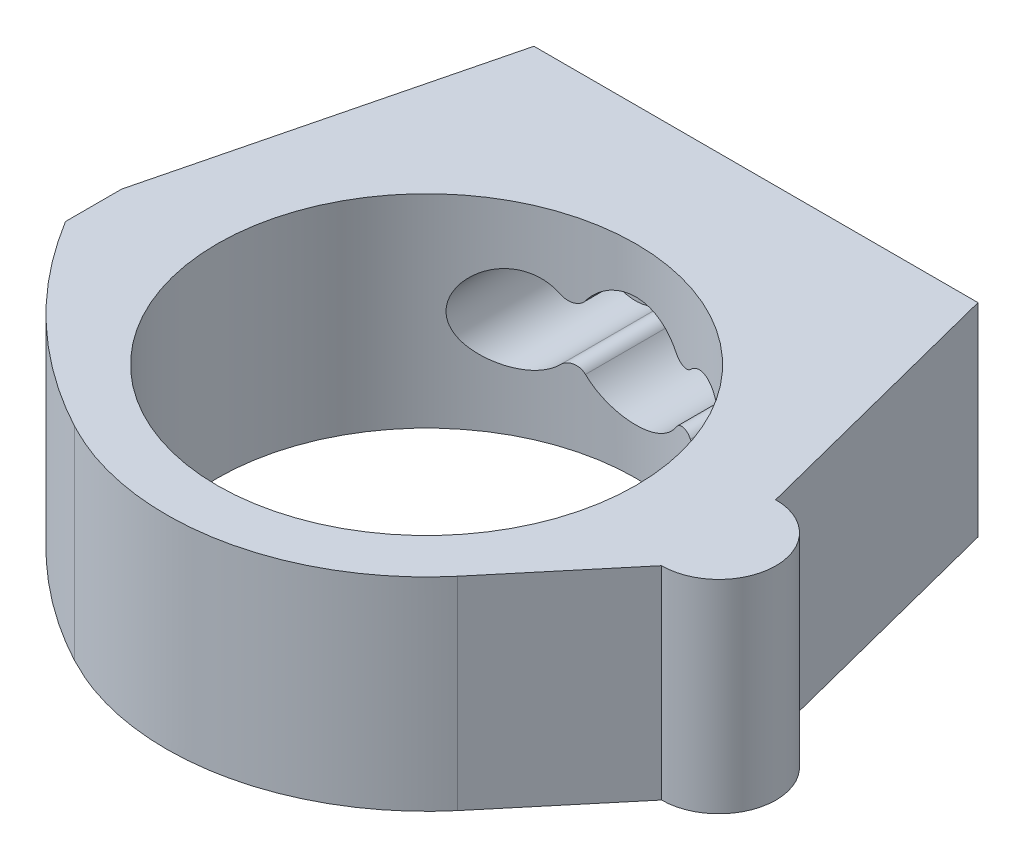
ISO-10303-21;
HEADER;
FILE_DESCRIPTION(('STEP AP214'),'2;1');
FILE_NAME('part.step','',(''),(''),'','','');
FILE_SCHEMA(('AUTOMOTIVE_DESIGN { 1 0 10303 214 1 1 1 1 }'));
ENDSEC;
DATA;
#1=APPLICATION_CONTEXT('core data for automotive mechanical design processes');
#2=APPLICATION_PROTOCOL_DEFINITION('international standard','automotive_design',2000,#1);
#3=PRODUCT_CONTEXT('',#1,'mechanical');
#4=PRODUCT('Part','Part','',(#3));
#5=PRODUCT_RELATED_PRODUCT_CATEGORY('part','',(#4));
#6=PRODUCT_DEFINITION_FORMATION('','',#4);
#7=PRODUCT_DEFINITION_CONTEXT('part definition',#1,'design');
#8=PRODUCT_DEFINITION('design','',#6,#7);
#9=PRODUCT_DEFINITION_SHAPE('','',#8);
#10=(LENGTH_UNIT() NAMED_UNIT(*) SI_UNIT(.MILLI.,.METRE.));
#11=(NAMED_UNIT(*) PLANE_ANGLE_UNIT() SI_UNIT($,.RADIAN.));
#12=(NAMED_UNIT(*) SI_UNIT($,.STERADIAN.) SOLID_ANGLE_UNIT());
#13=UNCERTAINTY_MEASURE_WITH_UNIT(LENGTH_MEASURE(1.E-05),#10,'distance_accuracy_value','');
#14=(GEOMETRIC_REPRESENTATION_CONTEXT(3) GLOBAL_UNCERTAINTY_ASSIGNED_CONTEXT((#13)) GLOBAL_UNIT_ASSIGNED_CONTEXT((#10,
#11,#12)) REPRESENTATION_CONTEXT('',''));
#15=CARTESIAN_POINT('',(0.,0.,0.));
#16=DIRECTION('',(0.,0.,1.));
#17=DIRECTION('',(1.,0.,0.));
#18=AXIS2_PLACEMENT_3D('',#15,#16,#17);
#19=CARTESIAN_POINT('',(-35.0021770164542,-16.,-51.9299847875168));
#20=DIRECTION('',(-0.970144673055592,0.,-0.242526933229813));
#21=DIRECTION('',(-0.242526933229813,0.,0.970144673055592));
#22=AXIS2_PLACEMENT_3D('',#19,#20,#21);
#23=PLANE('',#22);
#24=DIRECTION('',(-0.242526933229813,0.,0.970144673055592));
#25=VECTOR('',#24,1.);
#26=CARTESIAN_POINT('',(-35.0021770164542,16.,-51.9299847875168));
#27=LINE('',#26,#25);
#28=CARTESIAN_POINT('',(-35.0021770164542,16.,-51.9299847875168));
#29=VERTEX_POINT('',#28);
#30=CARTESIAN_POINT('',(-48.,16.,0.0632868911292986));
#31=VERTEX_POINT('',#30);
#32=EDGE_CURVE('E205',#29,#31,#27,.T.);
#33=ORIENTED_EDGE('',*,*,#32,.F.);
#34=DIRECTION('',(0.,1.,0.));
#35=VECTOR('',#34,1.);
#36=CARTESIAN_POINT('',(-35.0021770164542,-16.,-51.9299847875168));
#37=LINE('',#36,#35);
#38=CARTESIAN_POINT('',(-35.0021770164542,-16.,-51.9299847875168));
#39=VERTEX_POINT('',#38);
#40=EDGE_CURVE('E154',#39,#29,#37,.T.);
#41=ORIENTED_EDGE('',*,*,#40,.F.);
#42=DIRECTION('',(-0.242526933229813,0.,0.970144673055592));
#43=VECTOR('',#42,1.);
#44=CARTESIAN_POINT('',(-35.0021770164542,-16.,-51.9299847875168));
#45=LINE('',#44,#43);
#46=CARTESIAN_POINT('',(-48.,-16.,0.0632868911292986));
#47=VERTEX_POINT('',#46);
#48=EDGE_CURVE('E147',#39,#47,#45,.T.);
#49=ORIENTED_EDGE('',*,*,#48,.T.);
#50=DIRECTION('',(0.,1.,0.));
#51=VECTOR('',#50,1.);
#52=CARTESIAN_POINT('',(-48.,-16.,0.0632868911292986));
#53=LINE('',#52,#51);
#54=EDGE_CURVE('E129',#47,#31,#53,.T.);
#55=ORIENTED_EDGE('',*,*,#54,.T.);
#56=EDGE_LOOP('',(#33,#41,#49,#55));
#57=FACE_BOUND('',#56,.T.);
#58=ADVANCED_FACE('F16',(#57),#23,.T.);
#59=CARTESIAN_POINT('',(-35.0021770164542,-16.,-51.9299847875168));
#60=DIRECTION('',(0.,0.,-1.));
#61=DIRECTION('',(-1.,0.,0.));
#62=AXIS2_PLACEMENT_3D('',#59,#60,#61);
#63=PLANE('',#62);
#64=CARTESIAN_POINT('',(-15.,0.,-51.9299847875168));
#65=DIRECTION('',(0.,0.,-1.));
#66=DIRECTION('',(-1.,0.,0.));
#67=AXIS2_PLACEMENT_3D('',#64,#65,#66);
#68=CIRCLE('',#67,4.5);
#69=CARTESIAN_POINT('',(-19.5,0.,-51.9299847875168));
#70=VERTEX_POINT('',#69);
#71=EDGE_CURVE('E402',#70,#70,#68,.T.);
#72=ORIENTED_EDGE('',*,*,#71,.F.);
#73=EDGE_LOOP('',(#72));
#74=FACE_BOUND('',#73,.T.);
#75=CARTESIAN_POINT('',(15.,1.13130965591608E-13,-51.9299847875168));
#76=DIRECTION('',(0.,0.,-1.));
#77=DIRECTION('',(-1.,0.,0.));
#78=AXIS2_PLACEMENT_3D('',#75,#76,#77);
#79=CIRCLE('',#78,4.5);
#80=CARTESIAN_POINT('',(10.5,1.13130965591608E-13,-51.9299847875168));
#81=VERTEX_POINT('',#80);
#82=EDGE_CURVE('E399',#81,#81,#79,.T.);
#83=ORIENTED_EDGE('',*,*,#82,.F.);
#84=EDGE_LOOP('',(#83));
#85=FACE_BOUND('',#84,.T.);
#86=CARTESIAN_POINT('',(0.,0.,-51.9299847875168));
#87=DIRECTION('',(0.,0.,-1.));
#88=DIRECTION('',(-1.,0.,0.));
#89=AXIS2_PLACEMENT_3D('',#86,#87,#88);
#90=CIRCLE('',#89,5.5);
#91=CARTESIAN_POINT('',(-5.49999999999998,0.,-51.9299847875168));
#92=VERTEX_POINT('',#91);
#93=EDGE_CURVE('E395',#92,#92,#90,.T.);
#94=ORIENTED_EDGE('',*,*,#93,.F.);
#95=EDGE_LOOP('',(#94));
#96=FACE_BOUND('',#95,.T.);
#97=DIRECTION('',(-1.,0.,0.));
#98=VECTOR('',#97,1.);
#99=CARTESIAN_POINT('',(-35.0021770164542,16.,-51.9299847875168));
#100=LINE('',#99,#98);
#101=CARTESIAN_POINT('',(35.002227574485,16.,-51.9299847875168));
#102=VERTEX_POINT('',#101);
#103=EDGE_CURVE('E155',#102,#29,#100,.T.);
#104=ORIENTED_EDGE('',*,*,#103,.F.);
#105=DIRECTION('',(0.,1.,0.));
#106=VECTOR('',#105,1.);
#107=CARTESIAN_POINT('',(35.002227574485,-16.,-51.9299847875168));
#108=LINE('',#107,#106);
#109=CARTESIAN_POINT('',(35.002227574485,-16.,-51.9299847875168));
#110=VERTEX_POINT('',#109);
#111=EDGE_CURVE('E376',#110,#102,#108,.T.);
#112=ORIENTED_EDGE('',*,*,#111,.F.);
#113=DIRECTION('',(-1.,0.,0.));
#114=VECTOR('',#113,1.);
#115=CARTESIAN_POINT('',(-35.0021770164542,-16.,-51.9299847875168));
#116=LINE('',#115,#114);
#117=EDGE_CURVE('E140',#110,#39,#116,.T.);
#118=ORIENTED_EDGE('',*,*,#117,.T.);
#119=ORIENTED_EDGE('',*,*,#40,.T.);
#120=EDGE_LOOP('',(#104,#112,#118,#119));
#121=FACE_BOUND('',#120,.T.);
#122=ADVANCED_FACE('F272',(#74,#85,#96,#121),#63,.T.);
#123=CARTESIAN_POINT('',(35.002227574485,-16.,-51.9299847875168));
#124=DIRECTION('',(0.968804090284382,0.,-0.247827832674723));
#125=DIRECTION('',(-0.247827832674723,0.,-0.968804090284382));
#126=AXIS2_PLACEMENT_3D('',#123,#124,#125);
#127=PLANE('',#126);
#128=DIRECTION('',(-0.247827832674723,0.,-0.968804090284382));
#129=VECTOR('',#128,1.);
#130=CARTESIAN_POINT('',(35.002227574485,16.,-51.9299847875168));
#131=LINE('',#130,#129);
#132=CARTESIAN_POINT('',(45.9656614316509,16.,-9.07192703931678));
#133=VERTEX_POINT('',#132);
#134=EDGE_CURVE('E158',#133,#102,#131,.T.);
#135=ORIENTED_EDGE('',*,*,#134,.F.);
#136=DIRECTION('',(0.,1.,0.));
#137=VECTOR('',#136,1.);
#138=CARTESIAN_POINT('',(45.9656614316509,-16.,-9.07192703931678));
#139=LINE('',#138,#137);
#140=CARTESIAN_POINT('',(45.9656614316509,-16.,-9.07192703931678));
#141=VERTEX_POINT('',#140);
#142=EDGE_CURVE('E374',#141,#133,#139,.T.);
#143=ORIENTED_EDGE('',*,*,#142,.F.);
#144=DIRECTION('',(-0.247827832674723,0.,-0.968804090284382));
#145=VECTOR('',#144,1.);
#146=CARTESIAN_POINT('',(35.002227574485,-16.,-51.9299847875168));
#147=LINE('',#146,#145);
#148=EDGE_CURVE('E348',#141,#110,#147,.T.);
#149=ORIENTED_EDGE('',*,*,#148,.T.);
#150=ORIENTED_EDGE('',*,*,#111,.T.);
#151=EDGE_LOOP('',(#135,#143,#149,#150));
#152=FACE_BOUND('',#151,.T.);
#153=ADVANCED_FACE('F277',(#152),#127,.T.);
#154=CARTESIAN_POINT('',(46.,-16.,-0.0719925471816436));
#155=DIRECTION('',(0.,1.,0.));
#156=DIRECTION('',(0.,0.,1.));
#157=AXIS2_PLACEMENT_3D('',#154,#155,#156);
#158=CYLINDRICAL_SURFACE('',#157,9.);
#159=CARTESIAN_POINT('',(46.,16.,-0.0719925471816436));
#160=DIRECTION('',(0.,1.,0.));
#161=DIRECTION('',(0.,0.,1.));
#162=AXIS2_PLACEMENT_3D('',#159,#160,#161);
#163=CIRCLE('',#162,9.);
#164=CARTESIAN_POINT('',(45.9656614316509,16.,8.92794194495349));
#165=VERTEX_POINT('',#164);
#166=EDGE_CURVE('E312',#165,#133,#163,.T.);
#167=ORIENTED_EDGE('',*,*,#166,.F.);
#168=DIRECTION('',(0.,1.,0.));
#169=VECTOR('',#168,1.);
#170=CARTESIAN_POINT('',(45.9656614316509,-16.,8.92794194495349));
#171=LINE('',#170,#169);
#172=CARTESIAN_POINT('',(45.9656614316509,-16.,8.92794194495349));
#173=VERTEX_POINT('',#172);
#174=EDGE_CURVE('E308',#173,#165,#171,.T.);
#175=ORIENTED_EDGE('',*,*,#174,.F.);
#176=CARTESIAN_POINT('',(46.,-16.,-0.0719925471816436));
#177=DIRECTION('',(0.,1.,0.));
#178=DIRECTION('',(0.,0.,1.));
#179=AXIS2_PLACEMENT_3D('',#176,#177,#178);
#180=CIRCLE('',#179,9.);
#181=EDGE_CURVE('E346',#173,#141,#180,.T.);
#182=ORIENTED_EDGE('',*,*,#181,.T.);
#183=ORIENTED_EDGE('',*,*,#142,.T.);
#184=EDGE_LOOP('',(#167,#175,#182,#183));
#185=FACE_BOUND('',#184,.T.);
#186=ADVANCED_FACE('F284',(#185),#158,.T.);
#187=CARTESIAN_POINT('',(31.3149615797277,-16.,26.4645646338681));
#188=DIRECTION('',(0.767427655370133,0.,0.641135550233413));
#189=DIRECTION('',(0.641135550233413,0.,-0.767427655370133));
#190=AXIS2_PLACEMENT_3D('',#187,#188,#189);
#191=PLANE('',#190);
#192=DIRECTION('',(0.641135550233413,0.,-0.767427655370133));
#193=VECTOR('',#192,1.);
#194=CARTESIAN_POINT('',(31.3149615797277,16.,26.4645646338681));
#195=LINE('',#194,#193);
#196=CARTESIAN_POINT('',(31.3149615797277,16.,26.4645646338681));
#197=VERTEX_POINT('',#196);
#198=EDGE_CURVE('E303',#197,#165,#195,.T.);
#199=ORIENTED_EDGE('',*,*,#198,.F.);
#200=DIRECTION('',(0.,1.,0.));
#201=VECTOR('',#200,1.);
#202=CARTESIAN_POINT('',(31.3149615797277,-16.,26.4645646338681));
#203=LINE('',#202,#201);
#204=CARTESIAN_POINT('',(31.3149615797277,-16.,26.4645646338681));
#205=VERTEX_POINT('',#204);
#206=EDGE_CURVE('E306',#205,#197,#203,.T.);
#207=ORIENTED_EDGE('',*,*,#206,.F.);
#208=DIRECTION('',(0.641135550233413,0.,-0.767427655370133));
#209=VECTOR('',#208,1.);
#210=CARTESIAN_POINT('',(31.3149615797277,-16.,26.4645646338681));
#211=LINE('',#210,#209);
#212=EDGE_CURVE('E344',#205,#173,#211,.T.);
#213=ORIENTED_EDGE('',*,*,#212,.T.);
#214=ORIENTED_EDGE('',*,*,#174,.T.);
#215=EDGE_LOOP('',(#199,#207,#213,#214));
#216=FACE_BOUND('',#215,.T.);
#217=ADVANCED_FACE('F292',(#216),#191,.T.);
#218=CARTESIAN_POINT('',(-19.3919619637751,-16.,36.1238873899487));
#219=CARTESIAN_POINT('',(-18.1638444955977,-16.,36.7380005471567));
#220=CARTESIAN_POINT('',(-15.7191925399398,-16.,37.9604348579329));
#221=CARTESIAN_POINT('',(-11.8616855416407,-16.,39.3115590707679));
#222=CARTESIAN_POINT('',(-7.93912043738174,-16.,40.2921069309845));
#223=CARTESIAN_POINT('',(-3.97489779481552,-16.,40.871207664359));
#224=CARTESIAN_POINT('',(-0.0381439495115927,-16.,41.0619534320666));
#225=CARTESIAN_POINT('',(3.85521701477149,-16.,40.8790805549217));
#226=CARTESIAN_POINT('',(7.04881358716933,-16.,40.4256090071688));
#227=CARTESIAN_POINT('',(9.5810442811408,-16.,39.8806087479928));
#228=CARTESIAN_POINT('',(11.4694783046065,-16.,39.3791982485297));
#229=CARTESIAN_POINT('',(13.3388630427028,-16.,38.7860162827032));
#230=CARTESIAN_POINT('',(15.1846601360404,-16.,38.1014020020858));
#231=CARTESIAN_POINT('',(17.0022306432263,-16.,37.3259329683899));
#232=CARTESIAN_POINT('',(18.7869386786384,-16.,36.4604229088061));
#233=CARTESIAN_POINT('',(20.5341425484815,-16.,35.5059304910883));
#234=CARTESIAN_POINT('',(22.2391989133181,-16.,34.4637493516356));
#235=CARTESIAN_POINT('',(23.8975306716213,-16.,33.335458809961));
#236=CARTESIAN_POINT('',(25.5044275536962,-16.,32.1227456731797));
#237=CARTESIAN_POINT('',(27.0558593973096,-16.,30.828081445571));
#238=CARTESIAN_POINT('',(28.5454883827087,-16.,29.4521863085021));
#239=CARTESIAN_POINT('',(29.9759469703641,-16.,28.0035476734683));
#240=CARTESIAN_POINT('',(30.8680825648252,-16.,26.9781805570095));
#241=CARTESIAN_POINT('',(31.3149615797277,-16.,26.4645646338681));
#242=B_SPLINE_CURVE_WITH_KNOTS('',3,(#218,#219,#220,#221,#222,#223,#224,#225,#226,#227,#228,
#229,#230,#231,#232,#233,#234,#235,#236,#237,#238,#239,#240,#241),.UNSPECIFIED.,.F.,.F.,(4,1,1,
1,1,1,1,1,1,1,1,1,1,1,1,1,1,1,1,1,1,4),(0.,0.073733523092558,0.146771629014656,
0.219114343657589,0.290761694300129,0.361713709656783,0.430614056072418,0.499933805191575,
0.534789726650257,0.569778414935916,0.604899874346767,0.640154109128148,0.675541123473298,
0.711060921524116,0.746713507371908,0.782498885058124,0.818417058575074,0.854468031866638,
0.890651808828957,0.926968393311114,0.963417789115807,1.),.UNSPECIFIED.);
#243=DIRECTION('',(0.,1.,0.));
#244=VECTOR('',#243,1.);
#245=SURFACE_OF_LINEAR_EXTRUSION('',#242,#244);
#246=CARTESIAN_POINT('',(31.3149615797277,16.,26.4645646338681));
#247=CARTESIAN_POINT('',(30.8680825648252,16.,26.9781805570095));
#248=CARTESIAN_POINT('',(29.9759469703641,16.,28.0035476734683));
#249=CARTESIAN_POINT('',(28.5454883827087,16.,29.4521863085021));
#250=CARTESIAN_POINT('',(27.0558593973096,16.,30.828081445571));
#251=CARTESIAN_POINT('',(25.5044275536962,16.,32.1227456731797));
#252=CARTESIAN_POINT('',(23.8975306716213,16.,33.335458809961));
#253=CARTESIAN_POINT('',(22.2391989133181,16.,34.4637493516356));
#254=CARTESIAN_POINT('',(20.5341425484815,16.,35.5059304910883));
#255=CARTESIAN_POINT('',(18.7869386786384,16.,36.4604229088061));
#256=CARTESIAN_POINT('',(17.0022306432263,16.,37.3259329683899));
#257=CARTESIAN_POINT('',(15.1846601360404,16.,38.1014020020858));
#258=CARTESIAN_POINT('',(13.3388630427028,16.,38.7860162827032));
#259=CARTESIAN_POINT('',(11.4694783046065,16.,39.3791982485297));
#260=CARTESIAN_POINT('',(9.5810442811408,16.,39.8806087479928));
#261=CARTESIAN_POINT('',(7.04881358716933,16.,40.4256090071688));
#262=CARTESIAN_POINT('',(3.85521701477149,16.,40.8790805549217));
#263=CARTESIAN_POINT('',(-0.0381439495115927,16.,41.0619534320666));
#264=CARTESIAN_POINT('',(-3.97489779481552,16.,40.871207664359));
#265=CARTESIAN_POINT('',(-7.93912043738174,16.,40.2921069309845));
#266=CARTESIAN_POINT('',(-11.8616855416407,16.,39.3115590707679));
#267=CARTESIAN_POINT('',(-15.7191925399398,16.,37.9604348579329));
#268=CARTESIAN_POINT('',(-18.1638444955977,16.,36.7380005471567));
#269=CARTESIAN_POINT('',(-19.3919619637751,16.,36.1238873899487));
#270=B_SPLINE_CURVE_WITH_KNOTS('',3,(#246,#247,#248,#249,#250,#251,#252,#253,#254,#255,#256,
#257,#258,#259,#260,#261,#262,#263,#264,#265,#266,#267,#268,#269),.UNSPECIFIED.,.F.,.F.,(4,1,1,
1,1,1,1,1,1,1,1,1,1,1,1,1,1,1,1,1,1,4),(0.,0.036582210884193,0.073031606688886,
0.109348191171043,0.145531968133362,0.181582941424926,0.217501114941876,0.253286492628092,
0.288939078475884,0.324458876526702,0.359845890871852,0.395100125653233,0.430221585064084,
0.465210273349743,0.500066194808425,0.569385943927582,0.638286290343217,0.709238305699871,
0.780885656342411,0.853228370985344,0.926266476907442,1.),.UNSPECIFIED.);
#271=CARTESIAN_POINT('',(-19.3919619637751,16.,36.1238873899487));
#272=VERTEX_POINT('',#271);
#273=EDGE_CURVE('E313',#272,#197,#270,.F.);
#274=ORIENTED_EDGE('',*,*,#273,.F.);
#275=DIRECTION('',(0.,1.,0.));
#276=VECTOR('',#275,1.);
#277=CARTESIAN_POINT('',(-19.3919619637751,-16.,36.1238873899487));
#278=LINE('',#277,#276);
#279=CARTESIAN_POINT('',(-19.3919619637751,-16.,36.1238873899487));
#280=VERTEX_POINT('',#279);
#281=EDGE_CURVE('E341',#280,#272,#278,.T.);
#282=ORIENTED_EDGE('',*,*,#281,.F.);
#283=CARTESIAN_POINT('',(-19.3919619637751,-16.,36.1238873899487));
#284=CARTESIAN_POINT('',(-18.1638444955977,-16.,36.7380005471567));
#285=CARTESIAN_POINT('',(-15.7191925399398,-16.,37.9604348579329));
#286=CARTESIAN_POINT('',(-11.8616855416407,-16.,39.3115590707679));
#287=CARTESIAN_POINT('',(-7.93912043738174,-16.,40.2921069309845));
#288=CARTESIAN_POINT('',(-3.97489779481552,-16.,40.871207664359));
#289=CARTESIAN_POINT('',(-0.0381439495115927,-16.,41.0619534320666));
#290=CARTESIAN_POINT('',(3.85521701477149,-16.,40.8790805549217));
#291=CARTESIAN_POINT('',(7.04881358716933,-16.,40.4256090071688));
#292=CARTESIAN_POINT('',(9.5810442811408,-16.,39.8806087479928));
#293=CARTESIAN_POINT('',(11.4694783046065,-16.,39.3791982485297));
#294=CARTESIAN_POINT('',(13.3388630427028,-16.,38.7860162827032));
#295=CARTESIAN_POINT('',(15.1846601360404,-16.,38.1014020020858));
#296=CARTESIAN_POINT('',(17.0022306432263,-16.,37.3259329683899));
#297=CARTESIAN_POINT('',(18.7869386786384,-16.,36.4604229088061));
#298=CARTESIAN_POINT('',(20.5341425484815,-16.,35.5059304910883));
#299=CARTESIAN_POINT('',(22.2391989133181,-16.,34.4637493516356));
#300=CARTESIAN_POINT('',(23.8975306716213,-16.,33.335458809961));
#301=CARTESIAN_POINT('',(25.5044275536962,-16.,32.1227456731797));
#302=CARTESIAN_POINT('',(27.0558593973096,-16.,30.828081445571));
#303=CARTESIAN_POINT('',(28.5454883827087,-16.,29.4521863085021));
#304=CARTESIAN_POINT('',(29.9759469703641,-16.,28.0035476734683));
#305=CARTESIAN_POINT('',(30.8680825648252,-16.,26.9781805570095));
#306=CARTESIAN_POINT('',(31.3149615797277,-16.,26.4645646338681));
#307=B_SPLINE_CURVE_WITH_KNOTS('',3,(#283,#284,#285,#286,#287,#288,#289,#290,#291,#292,#293,
#294,#295,#296,#297,#298,#299,#300,#301,#302,#303,#304,#305,#306),.UNSPECIFIED.,.F.,.F.,(4,1,1,
1,1,1,1,1,1,1,1,1,1,1,1,1,1,1,1,1,1,4),(0.,0.073733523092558,0.146771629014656,
0.219114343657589,0.290761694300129,0.361713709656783,0.430614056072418,0.499933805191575,
0.534789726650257,0.569778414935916,0.604899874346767,0.640154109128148,0.675541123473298,
0.711060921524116,0.746713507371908,0.782498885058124,0.818417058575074,0.854468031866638,
0.890651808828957,0.926968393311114,0.963417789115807,1.),.UNSPECIFIED.);
#308=EDGE_CURVE('E342',#280,#205,#307,.T.);
#309=ORIENTED_EDGE('',*,*,#308,.T.);
#310=ORIENTED_EDGE('',*,*,#206,.T.);
#311=EDGE_LOOP('',(#274,#282,#309,#310));
#312=FACE_BOUND('',#311,.T.);
#313=ADVANCED_FACE('F181',(#312),#245,.T.);
#314=CARTESIAN_POINT('',(-48.,-16.,8.92741831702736));
#315=CARTESIAN_POINT('',(-47.5238612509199,-16.,9.65413206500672));
#316=CARTESIAN_POINT('',(-46.8599172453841,-16.,10.7286177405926));
#317=CARTESIAN_POINT('',(-45.9448480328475,-16.,12.1079550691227));
#318=CARTESIAN_POINT('',(-45.2798092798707,-16.,13.0791221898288));
#319=CARTESIAN_POINT('',(-44.60218314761,-16.,14.035334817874));
#320=CARTESIAN_POINT('',(-43.9127183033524,-16.,14.9767370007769));
#321=CARTESIAN_POINT('',(-43.2116744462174,-16.,15.9031747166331));
#322=CARTESIAN_POINT('',(-42.4994392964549,-16.,16.8145834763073));
#323=CARTESIAN_POINT('',(-41.7763641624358,-16.,17.7108849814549));
#324=CARTESIAN_POINT('',(-41.0428075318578,-16.,18.5920144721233));
#325=CARTESIAN_POINT('',(-40.299123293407,-16.,19.4579132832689));
#326=CARTESIAN_POINT('',(-39.5456637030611,-16.,20.3085306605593));
#327=CARTESIAN_POINT('',(-38.7827784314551,-16.,21.1438231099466));
#328=CARTESIAN_POINT('',(-38.0108146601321,-16.,21.9637544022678));
#329=CARTESIAN_POINT('',(-37.2301169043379,-16.,22.7682954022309));
#330=CARTESIAN_POINT('',(-36.441026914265,-16.,23.5574239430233));
#331=CARTESIAN_POINT('',(-35.6438835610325,-16.,24.3311246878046));
#332=CARTESIAN_POINT('',(-34.8390227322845,-16.,25.0893889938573));
#333=CARTESIAN_POINT('',(-34.0267772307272,-16.,25.8322147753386));
#334=CARTESIAN_POINT('',(-33.2074766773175,-16.,26.5596063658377));
#335=CARTESIAN_POINT('',(-32.3814474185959,-16.,27.2715743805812));
#336=CARTESIAN_POINT('',(-31.5490124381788,-16.,27.9681355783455));
#337=CARTESIAN_POINT('',(-30.7104912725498,-16.,28.6493127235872));
#338=CARTESIAN_POINT('',(-29.8661999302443,-16.,29.3151344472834));
#339=CARTESIAN_POINT('',(-29.0164508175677,-16.,29.9656351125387));
#340=CARTESIAN_POINT('',(-28.1615526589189,-16.,30.6008546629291));
#341=CARTESIAN_POINT('',(-27.30181045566,-16.,31.2208385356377));
#342=CARTESIAN_POINT('',(-26.4375253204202,-16.,31.8256373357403));
#343=CARTESIAN_POINT('',(-25.5689947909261,-16.,32.4153073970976));
#344=CARTESIAN_POINT('',(-24.6965113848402,-16.,32.989908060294));
#345=CARTESIAN_POINT('',(-23.820367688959,-16.,33.5495111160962));
#346=CARTESIAN_POINT('',(-22.9408372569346,-16.,34.0941651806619));
#347=CARTESIAN_POINT('',(-22.0582451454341,-16.,34.6240270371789));
#348=CARTESIAN_POINT('',(-21.1727063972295,-16.,35.138874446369));
#349=CARTESIAN_POINT('',(-20.2850946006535,-16.,35.6399102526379));
#350=CARTESIAN_POINT('',(-19.6891755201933,-16.,35.9628311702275));
#351=CARTESIAN_POINT('',(-19.3919619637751,-16.,36.1238873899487));
#352=B_SPLINE_CURVE_WITH_KNOTS('',3,(#314,#315,#316,#317,#318,#319,#320,#321,#322,#323,#324,
#325,#326,#327,#328,#329,#330,#331,#332,#333,#334,#335,#336,#337,#338,#339,#340,#341,#342,#343,
#344,#345,#346,#347,#348,#349,#350,#351),.UNSPECIFIED.,.F.,.F.,(4,1,1,1,1,1,1,1,1,1,1,1,1,1,1,1,
1,1,1,1,1,1,1,1,1,1,1,1,1,1,1,1,1,1,1,4),(-3.49107538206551E-13,0.0676585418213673,
0.0983443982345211,0.128898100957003,0.159319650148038,0.18960904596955,0.219766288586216,
0.249791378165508,0.279684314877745,0.309445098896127,0.339073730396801,0.368570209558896,
0.397934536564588,0.427166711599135,0.456266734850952,0.485234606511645,0.514070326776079,
0.542773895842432,0.571345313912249,0.599784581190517,0.628091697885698,0.656266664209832,
0.68430948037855,0.712220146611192,0.739998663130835,0.767645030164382,0.795159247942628,
0.822541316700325,0.84979123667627,0.876909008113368,0.903894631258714,0.930748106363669,
0.957469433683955,0.984058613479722,1.01051564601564,1.03684053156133),.UNSPECIFIED.);
#353=DIRECTION('',(0.,1.,0.));
#354=VECTOR('',#353,1.);
#355=SURFACE_OF_LINEAR_EXTRUSION('',#352,#354);
#356=CARTESIAN_POINT('',(-19.3919619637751,16.,36.1238873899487));
#357=CARTESIAN_POINT('',(-19.6891755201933,16.,35.9628311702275));
#358=CARTESIAN_POINT('',(-20.2850946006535,16.,35.6399102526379));
#359=CARTESIAN_POINT('',(-21.1727063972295,16.,35.138874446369));
#360=CARTESIAN_POINT('',(-22.0582451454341,16.,34.6240270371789));
#361=CARTESIAN_POINT('',(-22.9408372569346,16.,34.0941651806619));
#362=CARTESIAN_POINT('',(-23.820367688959,16.,33.5495111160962));
#363=CARTESIAN_POINT('',(-24.6965113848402,16.,32.989908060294));
#364=CARTESIAN_POINT('',(-25.5689947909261,16.,32.4153073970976));
#365=CARTESIAN_POINT('',(-26.4375253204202,16.,31.8256373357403));
#366=CARTESIAN_POINT('',(-27.30181045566,16.,31.2208385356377));
#367=CARTESIAN_POINT('',(-28.1615526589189,16.,30.6008546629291));
#368=CARTESIAN_POINT('',(-29.0164508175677,16.,29.9656351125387));
#369=CARTESIAN_POINT('',(-29.8661999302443,16.,29.3151344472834));
#370=CARTESIAN_POINT('',(-30.7104912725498,16.,28.6493127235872));
#371=CARTESIAN_POINT('',(-31.5490124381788,16.,27.9681355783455));
#372=CARTESIAN_POINT('',(-32.3814474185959,16.,27.2715743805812));
#373=CARTESIAN_POINT('',(-33.2074766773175,16.,26.5596063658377));
#374=CARTESIAN_POINT('',(-34.0267772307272,16.,25.8322147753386));
#375=CARTESIAN_POINT('',(-34.8390227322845,16.,25.0893889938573));
#376=CARTESIAN_POINT('',(-35.6438835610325,16.,24.3311246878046));
#377=CARTESIAN_POINT('',(-36.441026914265,16.,23.5574239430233));
#378=CARTESIAN_POINT('',(-37.2301169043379,16.,22.7682954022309));
#379=CARTESIAN_POINT('',(-38.0108146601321,16.,21.9637544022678));
#380=CARTESIAN_POINT('',(-38.7827784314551,16.,21.1438231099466));
#381=CARTESIAN_POINT('',(-39.5456637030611,16.,20.3085306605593));
#382=CARTESIAN_POINT('',(-40.299123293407,16.,19.4579132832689));
#383=CARTESIAN_POINT('',(-41.0428075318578,16.,18.5920144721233));
#384=CARTESIAN_POINT('',(-41.7763641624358,16.,17.7108849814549));
#385=CARTESIAN_POINT('',(-42.4994392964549,16.,16.8145834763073));
#386=CARTESIAN_POINT('',(-43.2116744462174,16.,15.9031747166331));
#387=CARTESIAN_POINT('',(-43.9127183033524,16.,14.9767370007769));
#388=CARTESIAN_POINT('',(-44.60218314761,16.,14.035334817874));
#389=CARTESIAN_POINT('',(-45.2798092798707,16.,13.0791221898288));
#390=CARTESIAN_POINT('',(-45.9448480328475,16.,12.1079550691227));
#391=CARTESIAN_POINT('',(-46.8599172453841,16.,10.7286177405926));
#392=CARTESIAN_POINT('',(-47.5238612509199,16.,9.65413206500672));
#393=CARTESIAN_POINT('',(-48.,16.,8.92741831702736));
#394=B_SPLINE_CURVE_WITH_KNOTS('',3,(#356,#357,#358,#359,#360,#361,#362,#363,#364,#365,#366,
#367,#368,#369,#370,#371,#372,#373,#374,#375,#376,#377,#378,#379,#380,#381,#382,#383,#384,#385,
#386,#387,#388,#389,#390,#391,#392,#393),.UNSPECIFIED.,.F.,.F.,(4,1,1,1,1,1,1,1,1,1,1,1,1,1,1,1,
1,1,1,1,1,1,1,1,1,1,1,1,1,1,1,1,1,1,1,4),(-3.49054118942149E-13,0.0263248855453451,
0.052781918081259,0.079371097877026,0.106092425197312,0.132945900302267,0.159931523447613,
0.187049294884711,0.214299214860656,0.241681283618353,0.269195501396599,0.296841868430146,
0.324620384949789,0.352531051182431,0.380573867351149,0.408748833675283,0.437055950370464,
0.465495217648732,0.494066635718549,0.522770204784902,0.551605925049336,0.580573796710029,
0.609673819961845,0.638905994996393,0.668270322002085,0.69776680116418,0.727395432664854,
0.757156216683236,0.787049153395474,0.817074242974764,0.847231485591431,0.877520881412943,
0.907942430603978,0.93849613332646,0.969181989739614,1.03684053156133),.UNSPECIFIED.);
#395=CARTESIAN_POINT('',(-48.,16.,8.92741831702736));
#396=VERTEX_POINT('',#395);
#397=EDGE_CURVE('E204',#396,#272,#394,.F.);
#398=ORIENTED_EDGE('',*,*,#397,.F.);
#399=DIRECTION('',(0.,1.,0.));
#400=VECTOR('',#399,1.);
#401=CARTESIAN_POINT('',(-48.,-16.,8.92741831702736));
#402=LINE('',#401,#400);
#403=CARTESIAN_POINT('',(-48.,-16.,8.92741831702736));
#404=VERTEX_POINT('',#403);
#405=EDGE_CURVE('E139',#404,#396,#402,.T.);
#406=ORIENTED_EDGE('',*,*,#405,.F.);
#407=CARTESIAN_POINT('',(-48.,-16.,8.92741831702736));
#408=CARTESIAN_POINT('',(-47.5238612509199,-16.,9.65413206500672));
#409=CARTESIAN_POINT('',(-46.8599172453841,-16.,10.7286177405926));
#410=CARTESIAN_POINT('',(-45.9448480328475,-16.,12.1079550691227));
#411=CARTESIAN_POINT('',(-45.2798092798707,-16.,13.0791221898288));
#412=CARTESIAN_POINT('',(-44.60218314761,-16.,14.035334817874));
#413=CARTESIAN_POINT('',(-43.9127183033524,-16.,14.9767370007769));
#414=CARTESIAN_POINT('',(-43.2116744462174,-16.,15.9031747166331));
#415=CARTESIAN_POINT('',(-42.4994392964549,-16.,16.8145834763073));
#416=CARTESIAN_POINT('',(-41.7763641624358,-16.,17.7108849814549));
#417=CARTESIAN_POINT('',(-41.0428075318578,-16.,18.5920144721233));
#418=CARTESIAN_POINT('',(-40.299123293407,-16.,19.4579132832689));
#419=CARTESIAN_POINT('',(-39.5456637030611,-16.,20.3085306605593));
#420=CARTESIAN_POINT('',(-38.7827784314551,-16.,21.1438231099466));
#421=CARTESIAN_POINT('',(-38.0108146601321,-16.,21.9637544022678));
#422=CARTESIAN_POINT('',(-37.2301169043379,-16.,22.7682954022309));
#423=CARTESIAN_POINT('',(-36.441026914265,-16.,23.5574239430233));
#424=CARTESIAN_POINT('',(-35.6438835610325,-16.,24.3311246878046));
#425=CARTESIAN_POINT('',(-34.8390227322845,-16.,25.0893889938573));
#426=CARTESIAN_POINT('',(-34.0267772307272,-16.,25.8322147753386));
#427=CARTESIAN_POINT('',(-33.2074766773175,-16.,26.5596063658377));
#428=CARTESIAN_POINT('',(-32.3814474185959,-16.,27.2715743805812));
#429=CARTESIAN_POINT('',(-31.5490124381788,-16.,27.9681355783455));
#430=CARTESIAN_POINT('',(-30.7104912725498,-16.,28.6493127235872));
#431=CARTESIAN_POINT('',(-29.8661999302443,-16.,29.3151344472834));
#432=CARTESIAN_POINT('',(-29.0164508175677,-16.,29.9656351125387));
#433=CARTESIAN_POINT('',(-28.1615526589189,-16.,30.6008546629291));
#434=CARTESIAN_POINT('',(-27.30181045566,-16.,31.2208385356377));
#435=CARTESIAN_POINT('',(-26.4375253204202,-16.,31.8256373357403));
#436=CARTESIAN_POINT('',(-25.5689947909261,-16.,32.4153073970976));
#437=CARTESIAN_POINT('',(-24.6965113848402,-16.,32.989908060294));
#438=CARTESIAN_POINT('',(-23.820367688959,-16.,33.5495111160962));
#439=CARTESIAN_POINT('',(-22.9408372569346,-16.,34.0941651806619));
#440=CARTESIAN_POINT('',(-22.0582451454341,-16.,34.6240270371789));
#441=CARTESIAN_POINT('',(-21.1727063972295,-16.,35.138874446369));
#442=CARTESIAN_POINT('',(-20.2850946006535,-16.,35.6399102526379));
#443=CARTESIAN_POINT('',(-19.6891755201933,-16.,35.9628311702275));
#444=CARTESIAN_POINT('',(-19.3919619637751,-16.,36.1238873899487));
#445=B_SPLINE_CURVE_WITH_KNOTS('',3,(#407,#408,#409,#410,#411,#412,#413,#414,#415,#416,#417,
#418,#419,#420,#421,#422,#423,#424,#425,#426,#427,#428,#429,#430,#431,#432,#433,#434,#435,#436,
#437,#438,#439,#440,#441,#442,#443,#444),.UNSPECIFIED.,.F.,.F.,(4,1,1,1,1,1,1,1,1,1,1,1,1,1,1,1,
1,1,1,1,1,1,1,1,1,1,1,1,1,1,1,1,1,1,1,4),(-3.49107538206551E-13,0.0676585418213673,
0.0983443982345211,0.128898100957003,0.159319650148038,0.18960904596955,0.219766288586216,
0.249791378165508,0.279684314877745,0.309445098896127,0.339073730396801,0.368570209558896,
0.397934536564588,0.427166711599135,0.456266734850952,0.485234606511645,0.514070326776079,
0.542773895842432,0.571345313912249,0.599784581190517,0.628091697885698,0.656266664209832,
0.68430948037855,0.712220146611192,0.739998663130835,0.767645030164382,0.795159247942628,
0.822541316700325,0.84979123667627,0.876909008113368,0.903894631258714,0.930748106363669,
0.957469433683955,0.984058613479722,1.01051564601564,1.03684053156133),.UNSPECIFIED.);
#446=EDGE_CURVE('E151',#404,#280,#445,.T.);
#447=ORIENTED_EDGE('',*,*,#446,.T.);
#448=ORIENTED_EDGE('',*,*,#281,.T.);
#449=EDGE_LOOP('',(#398,#406,#447,#448));
#450=FACE_BOUND('',#449,.T.);
#451=ADVANCED_FACE('F176',(#450),#355,.T.);
#452=CARTESIAN_POINT('',(-48.,-16.,0.0632868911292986));
#453=DIRECTION('',(-1.,0.,0.));
#454=DIRECTION('',(0.,0.,1.));
#455=AXIS2_PLACEMENT_3D('',#452,#453,#454);
#456=PLANE('',#455);
#457=DIRECTION('',(0.,0.,1.));
#458=VECTOR('',#457,1.);
#459=CARTESIAN_POINT('',(-48.,16.,0.0632868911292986));
#460=LINE('',#459,#458);
#461=EDGE_CURVE('E134',#31,#396,#460,.T.);
#462=ORIENTED_EDGE('',*,*,#461,.F.);
#463=ORIENTED_EDGE('',*,*,#54,.F.);
#464=DIRECTION('',(0.,0.,1.));
#465=VECTOR('',#464,1.);
#466=CARTESIAN_POINT('',(-48.,-16.,0.0632868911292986));
#467=LINE('',#466,#465);
#468=EDGE_CURVE('E132',#47,#404,#467,.T.);
#469=ORIENTED_EDGE('',*,*,#468,.T.);
#470=ORIENTED_EDGE('',*,*,#405,.T.);
#471=EDGE_LOOP('',(#462,#463,#469,#470));
#472=FACE_BOUND('',#471,.T.);
#473=ADVANCED_FACE('F131',(#472),#456,.T.);
#474=CARTESIAN_POINT('',(-35.5195128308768,-16.,24.4459864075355));
#475=DIRECTION('',(0.,1.,0.));
#476=DIRECTION('',(0.,0.,1.));
#477=AXIS2_PLACEMENT_3D('',#474,#475,#476);
#478=PLANE('',#477);
#479=CARTESIAN_POINT('',(0.,-16.,0.));
#480=DIRECTION('',(0.,1.,0.));
#481=DIRECTION('',(0.,0.,1.));
#482=AXIS2_PLACEMENT_3D('',#479,#480,#481);
#483=CIRCLE('',#482,33.);
#484=CARTESIAN_POINT('',(0.,-16.,33.));
#485=VERTEX_POINT('',#484);
#486=EDGE_CURVE('E383',#485,#485,#483,.T.);
#487=ORIENTED_EDGE('',*,*,#486,.T.);
#488=EDGE_LOOP('',(#487));
#489=FACE_BOUND('',#488,.T.);
#490=ORIENTED_EDGE('',*,*,#48,.F.);
#491=ORIENTED_EDGE('',*,*,#117,.F.);
#492=ORIENTED_EDGE('',*,*,#148,.F.);
#493=ORIENTED_EDGE('',*,*,#181,.F.);
#494=ORIENTED_EDGE('',*,*,#212,.F.);
#495=ORIENTED_EDGE('',*,*,#308,.F.);
#496=ORIENTED_EDGE('',*,*,#446,.F.);
#497=ORIENTED_EDGE('',*,*,#468,.F.);
#498=EDGE_LOOP('',(#490,#491,#492,#493,#494,#495,#496,#497));
#499=FACE_BOUND('',#498,.T.);
#500=ADVANCED_FACE('F145',(#489,#499),#478,.F.);
#501=CARTESIAN_POINT('',(-35.5195128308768,16.,24.4459864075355));
#502=DIRECTION('',(0.,1.,0.));
#503=DIRECTION('',(0.,0.,1.));
#504=AXIS2_PLACEMENT_3D('',#501,#502,#503);
#505=PLANE('',#504);
#506=CARTESIAN_POINT('',(0.,16.,0.));
#507=DIRECTION('',(0.,1.,0.));
#508=DIRECTION('',(0.,0.,1.));
#509=AXIS2_PLACEMENT_3D('',#506,#507,#508);
#510=CIRCLE('',#509,33.);
#511=CARTESIAN_POINT('',(0.,16.,33.));
#512=VERTEX_POINT('',#511);
#513=EDGE_CURVE('E162',#512,#512,#510,.T.);
#514=ORIENTED_EDGE('',*,*,#513,.F.);
#515=EDGE_LOOP('',(#514));
#516=FACE_BOUND('',#515,.T.);
#517=ORIENTED_EDGE('',*,*,#32,.T.);
#518=ORIENTED_EDGE('',*,*,#461,.T.);
#519=ORIENTED_EDGE('',*,*,#397,.T.);
#520=ORIENTED_EDGE('',*,*,#273,.T.);
#521=ORIENTED_EDGE('',*,*,#198,.T.);
#522=ORIENTED_EDGE('',*,*,#166,.T.);
#523=ORIENTED_EDGE('',*,*,#134,.T.);
#524=ORIENTED_EDGE('',*,*,#103,.T.);
#525=EDGE_LOOP('',(#517,#518,#519,#520,#521,#522,#523,#524));
#526=FACE_BOUND('',#525,.T.);
#527=ADVANCED_FACE('F235',(#516,#526),#505,.T.);
#528=CARTESIAN_POINT('',(0.,-16.,0.));
#529=DIRECTION('',(0.,1.,0.));
#530=DIRECTION('',(0.,0.,1.));
#531=AXIS2_PLACEMENT_3D('',#528,#529,#530);
#532=CYLINDRICAL_SURFACE('',#531,33.);
#533=CARTESIAN_POINT('',(-8.53333333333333,-1.93512847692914,-31.8776131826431));
#534=CARTESIAN_POINT('',(-8.47898611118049,-2.17490866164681,-31.892144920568));
#535=CARTESIAN_POINT('',(-8.41451913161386,-2.41221380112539,-31.9092695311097));
#536=CARTESIAN_POINT('',(-8.26602470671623,-2.88018237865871,-31.948067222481));
#537=CARTESIAN_POINT('',(-8.18200189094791,-3.11084737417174,-31.9697392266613));
#538=CARTESIAN_POINT('',(-7.99519548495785,-3.56360279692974,-32.0169647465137));
#539=CARTESIAN_POINT('',(-7.89244160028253,-3.78570613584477,-32.0425121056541));
#540=CARTESIAN_POINT('',(-7.66888340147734,-4.2202394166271,-32.0967517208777));
#541=CARTESIAN_POINT('',(-7.54807837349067,-4.43266897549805,-32.1254441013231));
#542=CARTESIAN_POINT('',(-7.28937881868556,-4.84633226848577,-32.1851294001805));
#543=CARTESIAN_POINT('',(-7.15149435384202,-5.04757249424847,-32.2161209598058));
#544=CARTESIAN_POINT('',(-6.85948340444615,-5.43777453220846,-32.2795572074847));
#545=CARTESIAN_POINT('',(-6.70535085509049,-5.62673171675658,-32.3120024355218));
#546=CARTESIAN_POINT('',(-6.38194485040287,-5.9910430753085,-32.3774301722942));
#547=CARTESIAN_POINT('',(-6.21267434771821,-6.16639988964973,-32.4104125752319));
#548=CARTESIAN_POINT('',(-5.85998313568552,-6.50249671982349,-32.4760339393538));
#549=CARTESIAN_POINT('',(-5.6765559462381,-6.66322996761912,-32.5086727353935));
#550=CARTESIAN_POINT('',(-5.29348253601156,-6.9715884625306,-32.5732622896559));
#551=CARTESIAN_POINT('',(-5.09360950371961,-7.1189367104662,-32.6051911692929));
#552=CARTESIAN_POINT('',(-4.68192403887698,-7.39619139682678,-32.6668468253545));
#553=CARTESIAN_POINT('',(-4.47011715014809,-7.5261058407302,-32.6965746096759));
#554=CARTESIAN_POINT('',(-4.03581886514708,-7.76765277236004,-32.7530170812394));
#555=CARTESIAN_POINT('',(-3.81332309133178,-7.87927768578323,-32.7797305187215));
#556=CARTESIAN_POINT('',(-3.35936505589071,-8.08325797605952,-32.8293583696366));
#557=CARTESIAN_POINT('',(-3.12790654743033,-8.17562131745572,-32.8522743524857));
#558=CARTESIAN_POINT('',(-2.66056882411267,-8.3393283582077,-32.893398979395));
#559=CARTESIAN_POINT('',(-2.42478241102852,-8.41092288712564,-32.9116634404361));
#560=CARTESIAN_POINT('',(-1.94770100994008,-8.53402883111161,-32.9433393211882));
#561=CARTESIAN_POINT('',(-1.70640605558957,-8.58554036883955,-32.9567507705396));
#562=CARTESIAN_POINT('',(-1.22015135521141,-8.66801757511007,-32.9783329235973));
#563=CARTESIAN_POINT('',(-0.975192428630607,-8.69898776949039,-32.9865047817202));
#564=CARTESIAN_POINT('',(-0.483414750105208,-8.74011957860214,-32.9973755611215));
#565=CARTESIAN_POINT('',(-0.23659603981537,-8.75028165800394,-33.0000746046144));
#566=CARTESIAN_POINT('',(0.249676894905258,-8.74971498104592,-32.9999245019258));
#567=CARTESIAN_POINT('',(0.489132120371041,-8.73959774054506,-32.9972377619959));
#568=CARTESIAN_POINT('',(0.966296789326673,-8.69977514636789,-32.9867127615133));
#569=CARTESIAN_POINT('',(1.20400621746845,-8.67006962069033,-32.9788744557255));
#570=CARTESIAN_POINT('',(1.67598404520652,-8.59132244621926,-32.9582596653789));
#571=CARTESIAN_POINT('',(1.91025238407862,-8.54228045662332,-32.945483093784));
#572=CARTESIAN_POINT('',(2.3737093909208,-8.42526714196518,-32.9153373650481));
#573=CARTESIAN_POINT('',(2.60289801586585,-8.35729565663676,-32.897968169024));
#574=CARTESIAN_POINT('',(3.05424028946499,-8.20310247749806,-32.8591362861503));
#575=CARTESIAN_POINT('',(3.27640550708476,-8.1169128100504,-32.8376807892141));
#576=CARTESIAN_POINT('',(3.712749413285,-7.92683093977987,-32.7912131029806));
#577=CARTESIAN_POINT('',(3.92692474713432,-7.82293140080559,-32.7661994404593));
#578=CARTESIAN_POINT('',(4.34579558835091,-7.59822608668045,-32.7132790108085));
#579=CARTESIAN_POINT('',(4.5504924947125,-7.47742281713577,-32.6853726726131));
#580=CARTESIAN_POINT('',(4.94917481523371,-7.21973068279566,-32.6273850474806));
#581=CARTESIAN_POINT('',(5.14315992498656,-7.08284136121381,-32.5973036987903));
#582=CARTESIAN_POINT('',(5.52463791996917,-6.78972636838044,-32.5348551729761));
#583=CARTESIAN_POINT('',(5.71178430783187,-6.63305824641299,-32.5024471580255));
#584=CARTESIAN_POINT('',(6.0722872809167,-6.30470264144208,-32.4370297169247));
#585=CARTESIAN_POINT('',(6.24564370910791,-6.13301498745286,-32.404020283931));
#586=CARTESIAN_POINT('',(6.57745881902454,-5.77572304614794,-32.3383000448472));
#587=CARTESIAN_POINT('',(6.73591648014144,-5.59011780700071,-32.3055892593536));
#588=CARTESIAN_POINT('',(7.03686892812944,-5.20619554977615,-32.2413733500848));
#589=CARTESIAN_POINT('',(7.17936371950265,-5.00787853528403,-32.2098682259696));
#590=CARTESIAN_POINT('',(7.45619524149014,-4.58642538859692,-32.1469534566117));
#591=CARTESIAN_POINT('',(7.58938696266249,-4.36251440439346,-32.1156851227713));
#592=CARTESIAN_POINT('',(7.83544326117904,-3.90335594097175,-32.0565410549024));
#593=CARTESIAN_POINT('',(7.94830748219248,-3.66810826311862,-32.0286653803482));
#594=CARTESIAN_POINT('',(8.15292733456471,-3.18756365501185,-31.9771955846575));
#595=CARTESIAN_POINT('',(8.24463895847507,-2.94224700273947,-31.9536104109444));
#596=CARTESIAN_POINT('',(8.40585672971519,-2.44393842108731,-31.9115678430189));
#597=CARTESIAN_POINT('',(8.47535780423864,-2.1909447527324,-31.8931116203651));
#598=CARTESIAN_POINT('',(8.53333333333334,-1.93512847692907,-31.8776131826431));
#599=B_SPLINE_CURVE_WITH_KNOTS('',3,(#533,#534,#535,#536,#537,#538,#539,#540,#541,#542,#543,
#544,#545,#546,#547,#548,#549,#550,#551,#552,#553,#554,#555,#556,#557,#558,#559,#560,#561,#562,
#563,#564,#565,#566,#567,#568,#569,#570,#571,#572,#573,#574,#575,#576,#577,#578,#579,#580,#581,
#582,#583,#584,#585,#586,#587,#588,#589,#590,#591,#592,#593,#594,#595,#596,#597,#598),
.UNSPECIFIED.,.F.,.F.,(4,2,2,2,2,2,2,2,2,2,2,2,2,2,2,2,2,2,2,2,2,2,2,2,2,2,2,2,2,2,2,2,4),(0.,
0.738608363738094,1.47704205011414,2.21431468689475,2.95161648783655,3.68848597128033,
4.42563148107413,5.16263352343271,5.89997494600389,6.65015621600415,7.3999918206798,
8.1501371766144,8.89997173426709,9.64033247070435,10.3806886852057,11.1208817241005,
11.8610582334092,12.5792507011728,13.2974494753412,14.0156609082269,14.7338784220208,
15.4508437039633,16.168106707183,16.8852635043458,17.6024406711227,18.3402165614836,
19.0780008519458,19.8158356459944,20.5536702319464,21.3398142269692,22.1259720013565,
22.9137508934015,23.7017095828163),.UNSPECIFIED.);
#600=CARTESIAN_POINT('',(-7.16279069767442,-5.02562726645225,-32.2132648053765));
#601=VERTEX_POINT('',#600);
#602=CARTESIAN_POINT('',(7.16279069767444,-5.02562726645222,-32.2132648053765));
#603=VERTEX_POINT('',#602);
#604=EDGE_CURVE('E415',#601,#603,#599,.T.);
#605=ORIENTED_EDGE('',*,*,#604,.F.);
#606=CARTESIAN_POINT('',(-7.16279069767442,-5.02562726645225,-32.2132648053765));
#607=CARTESIAN_POINT('',(-7.19535700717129,-4.97921155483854,-32.2060232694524));
#608=CARTESIAN_POINT('',(-7.22984652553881,-4.93425641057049,-32.1983026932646));
#609=CARTESIAN_POINT('',(-7.30240864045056,-4.84753434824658,-32.1819237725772));
#610=CARTESIAN_POINT('',(-7.34048059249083,-4.80576685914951,-32.173265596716));
#611=CARTESIAN_POINT('',(-7.45947280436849,-4.68584488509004,-32.1459616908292));
#612=CARTESIAN_POINT('',(-7.5453534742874,-4.61280988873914,-32.1259460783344));
#613=CARTESIAN_POINT('',(-7.72749784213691,-4.48250999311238,-32.0826204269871));
#614=CARTESIAN_POINT('',(-7.82376001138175,-4.42524277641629,-32.0593108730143));
#615=CARTESIAN_POINT('',(-8.02388525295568,-4.327714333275,-32.0098091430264));
#616=CARTESIAN_POINT('',(-8.12775005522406,-4.28745699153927,-31.9836163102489));
#617=CARTESIAN_POINT('',(-8.34235103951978,-4.22412746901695,-31.9283213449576));
#618=CARTESIAN_POINT('',(-8.45318546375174,-4.20143203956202,-31.899169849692));
#619=CARTESIAN_POINT('',(-8.67662920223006,-4.17498250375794,-31.8391188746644));
#620=CARTESIAN_POINT('',(-8.78923876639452,-4.17123108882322,-31.8082191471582));
#621=CARTESIAN_POINT('',(-9.01641874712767,-4.18274210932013,-31.7445822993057));
#622=CARTESIAN_POINT('',(-9.13095368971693,-4.19854901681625,-31.711817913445));
#623=CARTESIAN_POINT('',(-9.3556636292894,-4.24963390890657,-31.6462516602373));
#624=CARTESIAN_POINT('',(-9.46583788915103,-4.28491517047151,-31.6134497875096));
#625=CARTESIAN_POINT('',(-9.63196340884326,-4.35443947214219,-31.5630989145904));
#626=CARTESIAN_POINT('',(-9.69052083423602,-4.38236364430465,-31.5451643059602));
#627=CARTESIAN_POINT('',(-9.80479434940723,-4.44385256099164,-31.509833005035));
#628=CARTESIAN_POINT('',(-9.86051023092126,-4.47741771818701,-31.4924363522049));
#629=CARTESIAN_POINT('',(-9.9686960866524,-4.55002580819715,-31.4583585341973));
#630=CARTESIAN_POINT('',(-10.0211577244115,-4.58908203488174,-31.4416792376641));
#631=CARTESIAN_POINT('',(-10.1221942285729,-4.67231189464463,-31.4092982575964));
#632=CARTESIAN_POINT('',(-10.1707683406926,-4.71648651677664,-31.393596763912));
#633=CARTESIAN_POINT('',(-10.2171428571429,-4.76306388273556,-31.3784956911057));
#634=B_SPLINE_CURVE_WITH_KNOTS('',3,(#606,#607,#608,#609,#610,#611,#612,#613,#614,#615,#616,
#617,#618,#619,#620,#621,#622,#623,#624,#625,#626,#627,#628,#629,#630,#631,#632,#633),
.UNSPECIFIED.,.F.,.F.,(4,2,2,2,2,2,2,2,2,2,2,2,2,4),(0.,0.171373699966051,0.342716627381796,
0.684449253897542,1.02613162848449,1.36789199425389,1.71679509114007,2.06574775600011,
2.42463704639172,2.78358674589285,2.98525507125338,3.18693815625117,3.38911820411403,
3.59133738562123),.UNSPECIFIED.);
#635=CARTESIAN_POINT('',(-10.2171428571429,-4.76306388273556,-31.3784956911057));
#636=VERTEX_POINT('',#635);
#637=EDGE_CURVE('E249',#601,#636,#634,.T.);
#638=ORIENTED_EDGE('',*,*,#637,.T.);
#639=CARTESIAN_POINT('',(-8.53333333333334,1.93512847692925,-31.8776131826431));
#640=CARTESIAN_POINT('',(-8.58655831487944,2.11307942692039,-31.863357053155));
#641=CARTESIAN_POINT('',(-8.64712728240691,2.28865874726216,-31.8470086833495));
#642=CARTESIAN_POINT('',(-8.78230868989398,2.63383249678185,-31.8100000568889));
#643=CARTESIAN_POINT('',(-8.85691947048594,2.80342763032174,-31.7893403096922));
#644=CARTESIAN_POINT('',(-9.01940381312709,3.13512967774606,-31.743620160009));
#645=CARTESIAN_POINT('',(-9.107252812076,3.29724974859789,-31.7185678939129));
#646=CARTESIAN_POINT('',(-9.29552383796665,3.61320686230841,-31.6639045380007));
#647=CARTESIAN_POINT('',(-9.39594585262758,3.76704391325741,-31.6342934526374));
#648=CARTESIAN_POINT('',(-9.60846772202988,4.06539371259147,-31.5703920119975));
#649=CARTESIAN_POINT('',(-9.72056754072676,4.20990648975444,-31.5361016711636));
#650=CARTESIAN_POINT('',(-9.95548867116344,4.48872470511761,-31.4627301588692));
#651=CARTESIAN_POINT('',(-10.0783139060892,4.62302637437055,-31.4236472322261));
#652=CARTESIAN_POINT('',(-10.3335317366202,4.88051486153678,-31.3406464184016));
#653=CARTESIAN_POINT('',(-10.4659219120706,5.00370447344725,-31.2967297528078));
#654=CARTESIAN_POINT('',(-10.7391503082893,5.23832878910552,-31.2040295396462));
#655=CARTESIAN_POINT('',(-10.8799889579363,5.34976289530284,-31.1552457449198));
#656=CARTESIAN_POINT('',(-11.171292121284,5.56205987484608,-31.0519966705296));
#657=CARTESIAN_POINT('',(-11.3218769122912,5.66271857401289,-30.9974510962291));
#658=CARTESIAN_POINT('',(-11.6292596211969,5.85090482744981,-30.8834452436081));
#659=CARTESIAN_POINT('',(-11.7860577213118,5.9384319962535,-30.8239848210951));
#660=CARTESIAN_POINT('',(-12.1046089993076,6.10009145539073,-30.7002871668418));
#661=CARTESIAN_POINT('',(-12.2663626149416,6.17422255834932,-30.6360495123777));
#662=CARTESIAN_POINT('',(-12.5936263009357,6.30897759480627,-30.5029801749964));
#663=CARTESIAN_POINT('',(-12.7591376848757,6.3695967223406,-30.4341468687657));
#664=CARTESIAN_POINT('',(-13.1021671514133,6.4803565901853,-30.2881144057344));
#665=CARTESIAN_POINT('',(-13.2798333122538,6.52970678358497,-30.2106621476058));
#666=CARTESIAN_POINT('',(-13.6366991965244,6.61343699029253,-30.0512684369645));
#667=CARTESIAN_POINT('',(-13.8158994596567,6.64781149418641,-29.9693253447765));
#668=CARTESIAN_POINT('',(-14.3538806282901,6.72877145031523,-29.7173737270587));
#669=CARTESIAN_POINT('',(-14.7132833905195,6.75326973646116,-29.5411404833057));
#670=CARTESIAN_POINT('',(-15.4593372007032,6.7456723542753,-29.1582165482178));
#671=CARTESIAN_POINT('',(-15.8452399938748,6.70784255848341,-28.9502305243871));
#672=CARTESIAN_POINT('',(-16.5998974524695,6.56887778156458,-28.5242251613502));
#673=CARTESIAN_POINT('',(-16.9686399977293,6.46769876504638,-28.3061989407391));
#674=CARTESIAN_POINT('',(-17.7206837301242,6.19176328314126,-27.8422906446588));
#675=CARTESIAN_POINT('',(-18.1012109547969,6.01020481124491,-27.5959566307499));
#676=CARTESIAN_POINT('',(-18.8245100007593,5.57790932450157,-27.107709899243));
#677=CARTESIAN_POINT('',(-19.1672760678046,5.32716178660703,-26.8657978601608));
#678=CARTESIAN_POINT('',(-19.6245325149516,4.92040796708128,-26.5312524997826));
#679=CARTESIAN_POINT('',(-19.7583272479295,4.79121609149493,-26.4316975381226));
#680=CARTESIAN_POINT('',(-20.0162321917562,4.52049630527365,-26.236930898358));
#681=CARTESIAN_POINT('',(-20.1403424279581,4.37896842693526,-26.1417192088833));
#682=CARTESIAN_POINT('',(-20.4963583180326,3.93644812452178,-25.8648246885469));
#683=CARTESIAN_POINT('',(-20.7125668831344,3.61697598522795,-25.6914251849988));
#684=CARTESIAN_POINT('',(-21.0514430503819,3.00611014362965,-25.4140546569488));
#685=CARTESIAN_POINT('',(-21.1842279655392,2.72350676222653,-25.3031747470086));
#686=CARTESIAN_POINT('',(-21.3547233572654,2.28144429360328,-25.1591198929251));
#687=CARTESIAN_POINT('',(-21.4067811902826,2.13103697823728,-25.1148068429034));
#688=CARTESIAN_POINT('',(-21.5006010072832,1.82490599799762,-25.0345356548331));
#689=CARTESIAN_POINT('',(-21.5423674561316,1.6691846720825,-24.9985738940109));
#690=CARTESIAN_POINT('',(-21.6152201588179,1.35205513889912,-24.9356091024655));
#691=CARTESIAN_POINT('',(-21.6462144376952,1.19061033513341,-24.9086832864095));
#692=CARTESIAN_POINT('',(-21.6964382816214,0.864534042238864,-24.8649488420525));
#693=CARTESIAN_POINT('',(-21.7156678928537,0.69990256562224,-24.8481401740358));
#694=CARTESIAN_POINT('',(-21.74194768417,0.369014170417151,-24.8251489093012));
#695=CARTESIAN_POINT('',(-21.7490042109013,0.202758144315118,-24.8189607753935));
#696=CARTESIAN_POINT('',(-21.7507989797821,-0.129862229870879,-24.8173880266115));
#697=CARTESIAN_POINT('',(-21.7455384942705,-0.296226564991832,-24.8220022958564));
#698=CARTESIAN_POINT('',(-21.7242512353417,-0.606654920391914,-24.8406334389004));
#699=CARTESIAN_POINT('',(-21.7096588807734,-0.750896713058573,-24.853397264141));
#700=CARTESIAN_POINT('',(-21.6713861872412,-1.03729591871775,-24.8867769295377));
#701=CARTESIAN_POINT('',(-21.6477029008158,-1.17945264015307,-24.9073953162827));
#702=CARTESIAN_POINT('',(-21.5916179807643,-1.46069557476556,-24.9560294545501));
#703=CARTESIAN_POINT('',(-21.5592186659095,-1.59978259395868,-24.9840432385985));
#704=CARTESIAN_POINT('',(-21.4861350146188,-1.87422767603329,-25.0469224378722));
#705=CARTESIAN_POINT('',(-21.4454473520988,-2.00958421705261,-25.0817906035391));
#706=CARTESIAN_POINT('',(-21.3546752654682,-2.28074058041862,-25.159124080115));
#707=CARTESIAN_POINT('',(-21.3043036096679,-2.41637850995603,-25.2018190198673));
#708=CARTESIAN_POINT('',(-21.1957724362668,-2.68245457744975,-25.2931662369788));
#709=CARTESIAN_POINT('',(-21.137610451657,-2.81289105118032,-25.3418204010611));
#710=CARTESIAN_POINT('',(-20.9522804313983,-3.19582178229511,-25.4956416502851));
#711=CARTESIAN_POINT('',(-20.8142589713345,-3.43996480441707,-25.6086755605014));
#712=CARTESIAN_POINT('',(-20.4415732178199,-4.01481057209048,-25.9079663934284));
#713=CARTESIAN_POINT('',(-20.1922110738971,-4.33126565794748,-26.1034352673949));
#714=CARTESIAN_POINT('',(-19.7857437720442,-4.76429690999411,-26.4112407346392));
#715=CARTESIAN_POINT('',(-19.6446621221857,-4.9018384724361,-26.516411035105));
#716=CARTESIAN_POINT('',(-19.3525877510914,-5.16292653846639,-26.73032128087));
#717=CARTESIAN_POINT('',(-19.2015959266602,-5.28647430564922,-26.8390609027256));
#718=CARTESIAN_POINT('',(-18.7313801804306,-5.63861160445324,-27.1713722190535));
#719=CARTESIAN_POINT('',(-18.3980859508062,-5.84534804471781,-27.3986073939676));
#720=CARTESIAN_POINT('',(-17.7013776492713,-6.19817900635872,-27.8538018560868));
#721=CARTESIAN_POINT('',(-17.3379671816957,-6.34428077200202,-28.0817610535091));
#722=CARTESIAN_POINT('',(-16.7531208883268,-6.52205826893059,-28.4322562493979));
#723=CARTESIAN_POINT('',(-16.5395369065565,-6.57579897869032,-28.5570645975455));
#724=CARTESIAN_POINT('',(-16.106341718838,-6.6623778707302,-28.8036066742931));
#725=CARTESIAN_POINT('',(-15.8867299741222,-6.6952141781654,-28.9253401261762));
#726=CARTESIAN_POINT('',(-15.4430564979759,-6.73913239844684,-29.1646287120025));
#727=CARTESIAN_POINT('',(-15.2189942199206,-6.75021162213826,-29.2821833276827));
#728=CARTESIAN_POINT('',(-14.7682279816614,-6.74978233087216,-29.5120893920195));
#729=CARTESIAN_POINT('',(-14.5415242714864,-6.73827593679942,-29.6244413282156));
#730=CARTESIAN_POINT('',(-14.0995459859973,-6.69315941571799,-29.8372208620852));
#731=CARTESIAN_POINT('',(-13.884301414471,-6.66075113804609,-29.9379648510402));
#732=CARTESIAN_POINT('',(-13.4552825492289,-6.57451185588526,-30.1332191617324));
#733=CARTESIAN_POINT('',(-13.2415080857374,-6.52068336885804,-30.2277302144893));
#734=CARTESIAN_POINT('',(-12.8177856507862,-6.39135884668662,-30.4098258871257));
#735=CARTESIAN_POINT('',(-12.6078348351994,-6.31587967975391,-30.4974158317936));
#736=CARTESIAN_POINT('',(-12.1940015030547,-6.143217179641,-30.6652272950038));
#737=CARTESIAN_POINT('',(-11.990118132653,-6.04603691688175,-30.7454498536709));
#738=CARTESIAN_POINT('',(-11.6143906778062,-5.84296632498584,-30.8891815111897));
#739=CARTESIAN_POINT('',(-11.4415948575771,-5.73943717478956,-30.953547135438));
#740=CARTESIAN_POINT('',(-11.1044815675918,-5.51618468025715,-31.0760783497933));
#741=CARTESIAN_POINT('',(-10.9401631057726,-5.39646323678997,-31.1342446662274));
#742=CARTESIAN_POINT('',(-10.6217603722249,-5.14150927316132,-31.2443049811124));
#743=CARTESIAN_POINT('',(-10.467676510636,-5.00627613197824,-31.2961987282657));
#744=CARTESIAN_POINT('',(-10.1714760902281,-4.72123824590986,-31.3937157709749));
#745=CARTESIAN_POINT('',(-10.0293583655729,-4.57143492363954,-31.4393396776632));
#746=CARTESIAN_POINT('',(-9.77033062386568,-4.27186588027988,-31.520746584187));
#747=CARTESIAN_POINT('',(-9.65230394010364,-4.12320179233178,-31.5570382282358));
#748=CARTESIAN_POINT('',(-9.4287281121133,-3.81569856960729,-31.6245589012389));
#749=CARTESIAN_POINT('',(-9.3231778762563,-3.65686032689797,-31.6557883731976));
#750=CARTESIAN_POINT('',(-9.12573996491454,-3.3304496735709,-31.7132689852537));
#751=CARTESIAN_POINT('',(-9.03382875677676,-3.16289299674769,-31.7395287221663));
#752=CARTESIAN_POINT('',(-8.86436551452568,-2.82010776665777,-31.7872738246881));
#753=CARTESIAN_POINT('',(-8.78680519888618,-2.64488371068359,-31.8087619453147));
#754=CARTESIAN_POINT('',(-8.68254384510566,-2.37929337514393,-31.837315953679));
#755=CARTESIAN_POINT('',(-8.65010790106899,-2.29132461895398,-31.8461401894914));
#756=CARTESIAN_POINT('',(-8.58894382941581,-2.1141491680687,-31.8626904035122));
#757=CARTESIAN_POINT('',(-8.56021040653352,-2.02494444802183,-31.8704179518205));
#758=CARTESIAN_POINT('',(-8.53333333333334,-1.93512847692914,-31.8776131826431));
#759=B_SPLINE_CURVE_WITH_KNOTS('',3,(#639,#640,#641,#642,#643,#644,#645,#646,#647,#648,#649,
#650,#651,#652,#653,#654,#655,#656,#657,#658,#659,#660,#661,#662,#663,#664,#665,#666,#667,#668,
#669,#670,#671,#672,#673,#674,#675,#676,#677,#678,#679,#680,#681,#682,#683,#684,#685,#686,#687,
#688,#689,#690,#691,#692,#693,#694,#695,#696,#697,#698,#699,#700,#701,#702,#703,#704,#705,#706,
#707,#708,#709,#710,#711,#712,#713,#714,#715,#716,#717,#718,#719,#720,#721,#722,#723,#724,#725,
#726,#727,#728,#729,#730,#731,#732,#733,#734,#735,#736,#737,#738,#739,#740,#741,#742,#743,#744,
#745,#746,#747,#748,#749,#750,#751,#752,#753,#754,#755,#756,#757,#758),.UNSPECIFIED.,.F.,.F.,(4,
2,2,2,2,2,2,2,2,2,2,2,2,2,2,2,2,2,2,2,2,2,2,2,2,2,2,2,2,2,2,2,2,2,2,2,2,2,2,2,2,2,2,2,2,2,2,2,2,
2,2,2,2,2,2,2,2,2,2,4),(0.,0.558680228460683,1.11729447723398,1.67488471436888,2.23247440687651,
2.79006237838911,3.34785516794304,3.90550731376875,4.46318779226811,5.03004693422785,
5.5969227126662,6.16384871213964,6.73097603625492,7.33030974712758,7.92986376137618,
9.12816105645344,10.4429668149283,11.7586875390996,13.2174178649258,14.6763701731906,
15.3087114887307,15.9410511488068,17.2029379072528,18.192832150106,18.68794647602,
19.182845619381,19.6818720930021,20.1808966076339,20.6796608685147,21.178373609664,
21.6144815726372,22.0507310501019,22.4868645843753,22.9231734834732,23.3753029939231,
23.827576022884,24.732032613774,26.0678348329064,26.7373420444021,27.406788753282,
28.7611451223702,30.115339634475,30.873959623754,31.6326476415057,32.3914294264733,
33.1501399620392,33.8687029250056,34.5871814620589,35.3051017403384,36.0229205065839,
36.6564854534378,37.2899760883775,37.9234920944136,38.5569463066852,39.1359993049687,
39.7150016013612,40.2929929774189,40.870649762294,41.1530922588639,41.4351262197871),.UNSPECIFIED.);
#760=CARTESIAN_POINT('',(-10.2171428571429,4.76306388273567,-31.3784956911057));
#761=VERTEX_POINT('',#760);
#762=EDGE_CURVE('E432',#761,#636,#759,.T.);
#763=ORIENTED_EDGE('',*,*,#762,.F.);
#764=CARTESIAN_POINT('',(-10.2171428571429,4.76306388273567,-31.3784956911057));
#765=CARTESIAN_POINT('',(-10.1759856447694,4.72173734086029,-31.3918970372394));
#766=CARTESIAN_POINT('',(-10.1331212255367,4.68231050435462,-31.4057642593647));
#767=CARTESIAN_POINT('',(-10.0442896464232,4.6074599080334,-31.4342873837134));
#768=CARTESIAN_POINT('',(-9.99832318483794,4.57203525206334,-31.4489431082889));
#769=CARTESIAN_POINT('',(-9.85642028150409,4.47219191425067,-31.4938211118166));
#770=CARTESIAN_POINT('',(-9.75629415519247,4.41401796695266,-31.5250152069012));
#771=CARTESIAN_POINT('',(-9.54799099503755,4.31590780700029,-31.5887279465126));
#772=CARTESIAN_POINT('',(-9.43981679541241,4.27596520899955,-31.6212461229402));
#773=CARTESIAN_POINT('',(-9.21826094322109,4.21519751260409,-31.6865427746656));
#774=CARTESIAN_POINT('',(-9.10487818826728,4.19437648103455,-31.7193213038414));
#775=CARTESIAN_POINT('',(-8.87412675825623,4.17230328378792,-31.7846579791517));
#776=CARTESIAN_POINT('',(-8.75672321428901,4.17137728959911,-31.8172037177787));
#777=CARTESIAN_POINT('',(-8.52309755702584,4.19014178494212,-31.8805811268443));
#778=CARTESIAN_POINT('',(-8.40687535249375,4.20983066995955,-31.9114129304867));
#779=CARTESIAN_POINT('',(-8.18013929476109,4.2692460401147,-31.9702819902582));
#780=CARTESIAN_POINT('',(-8.06958310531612,4.30878846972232,-31.9983421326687));
#781=CARTESIAN_POINT('',(-7.85644497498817,4.40701554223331,-32.0513388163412));
#782=CARTESIAN_POINT('',(-7.75386100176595,4.46569528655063,-32.0762761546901));
#783=CARTESIAN_POINT('',(-7.60940482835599,4.56627762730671,-32.1107362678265));
#784=CARTESIAN_POINT('',(-7.56314662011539,4.60157727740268,-32.1216582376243));
#785=CARTESIAN_POINT('',(-7.47374809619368,4.67619636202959,-32.1425759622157));
#786=CARTESIAN_POINT('',(-7.43060766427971,4.7155156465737,-32.1525717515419));
#787=CARTESIAN_POINT('',(-7.34774441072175,4.79797837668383,-32.1716096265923));
#788=CARTESIAN_POINT('',(-7.30802875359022,4.84112947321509,-32.1806497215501));
#789=CARTESIAN_POINT('',(-7.23244043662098,4.9308763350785,-32.1977220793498));
#790=CARTESIAN_POINT('',(-7.19656861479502,4.97747284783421,-32.2057541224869));
#791=CARTESIAN_POINT('',(-7.16279069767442,5.02562726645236,-32.2132648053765));
#792=B_SPLINE_CURVE_WITH_KNOTS('',3,(#764,#765,#766,#767,#768,#769,#770,#771,#772,#773,#774,
#775,#776,#777,#778,#779,#780,#781,#782,#783,#784,#785,#786,#787,#788,#789,#790,#791),
.UNSPECIFIED.,.F.,.F.,(4,2,2,2,2,2,2,2,2,2,2,2,2,4),(0.,0.179414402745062,0.358788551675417,
0.716737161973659,1.07456030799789,1.43245953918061,1.79622199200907,2.15995613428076,
2.52037881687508,2.88070931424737,3.05813828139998,3.23556063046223,3.41334556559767,
3.59116918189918),.UNSPECIFIED.);
#793=CARTESIAN_POINT('',(-7.16279069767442,5.02562726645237,-32.2132648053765));
#794=VERTEX_POINT('',#793);
#795=EDGE_CURVE('E244',#761,#794,#792,.T.);
#796=ORIENTED_EDGE('',*,*,#795,.T.);
#797=CARTESIAN_POINT('',(8.53333333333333,1.93512847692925,-31.8776131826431));
#798=CARTESIAN_POINT('',(8.47898611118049,2.17490866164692,-31.892144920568));
#799=CARTESIAN_POINT('',(8.41451913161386,2.4122138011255,-31.9092695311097));
#800=CARTESIAN_POINT('',(8.26602470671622,2.88018237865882,-31.948067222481));
#801=CARTESIAN_POINT('',(8.1820018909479,3.11084737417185,-31.9697392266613));
#802=CARTESIAN_POINT('',(7.99519548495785,3.56360279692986,-32.0169647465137));
#803=CARTESIAN_POINT('',(7.89244160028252,3.78570613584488,-32.0425121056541));
#804=CARTESIAN_POINT('',(7.66888340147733,4.22023941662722,-32.0967517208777));
#805=CARTESIAN_POINT('',(7.54807837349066,4.43266897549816,-32.1254441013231));
#806=CARTESIAN_POINT('',(7.28937881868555,4.84633226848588,-32.1851294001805));
#807=CARTESIAN_POINT('',(7.15149435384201,5.04757249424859,-32.2161209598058));
#808=CARTESIAN_POINT('',(6.85948340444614,5.43777453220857,-32.2795572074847));
#809=CARTESIAN_POINT('',(6.70535085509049,5.6267317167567,-32.3120024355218));
#810=CARTESIAN_POINT('',(6.38194485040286,5.99104307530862,-32.3774301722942));
#811=CARTESIAN_POINT('',(6.2126743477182,6.16639988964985,-32.4104125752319));
#812=CARTESIAN_POINT('',(5.85998313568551,6.5024967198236,-32.4760339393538));
#813=CARTESIAN_POINT('',(5.67655594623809,6.66322996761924,-32.5086727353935));
#814=CARTESIAN_POINT('',(5.29348253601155,6.97158846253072,-32.5732622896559));
#815=CARTESIAN_POINT('',(5.0936095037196,7.11893671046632,-32.6051911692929));
#816=CARTESIAN_POINT('',(4.68192403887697,7.3961913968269,-32.6668468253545));
#817=CARTESIAN_POINT('',(4.47011715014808,7.52610584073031,-32.6965746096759));
#818=CARTESIAN_POINT('',(4.03581886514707,7.76765277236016,-32.7530170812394));
#819=CARTESIAN_POINT('',(3.81332309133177,7.87927768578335,-32.7797305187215));
#820=CARTESIAN_POINT('',(3.3593650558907,8.08325797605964,-32.8293583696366));
#821=CARTESIAN_POINT('',(3.12790654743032,8.17562131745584,-32.8522743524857));
#822=CARTESIAN_POINT('',(2.66056882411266,8.33932835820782,-32.893398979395));
#823=CARTESIAN_POINT('',(2.42478241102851,8.41092288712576,-32.9116634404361));
#824=CARTESIAN_POINT('',(1.94770100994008,8.53402883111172,-32.9433393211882));
#825=CARTESIAN_POINT('',(1.70640605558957,8.58554036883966,-32.9567507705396));
#826=CARTESIAN_POINT('',(1.2201513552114,8.66801757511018,-32.9783329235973));
#827=CARTESIAN_POINT('',(0.975192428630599,8.6989877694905,-32.9865047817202));
#828=CARTESIAN_POINT('',(0.4834147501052,8.74011957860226,-32.9973755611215));
#829=CARTESIAN_POINT('',(0.236596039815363,8.75028165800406,-33.0000746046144));
#830=CARTESIAN_POINT('',(-0.249676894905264,8.74971498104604,-32.9999245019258));
#831=CARTESIAN_POINT('',(-0.489132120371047,8.73959774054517,-32.9972377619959));
#832=CARTESIAN_POINT('',(-0.966296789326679,8.699775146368,-32.9867127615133));
#833=CARTESIAN_POINT('',(-1.20400621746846,8.67006962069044,-32.9788744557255));
#834=CARTESIAN_POINT('',(-1.67598404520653,8.59132244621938,-32.9582596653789));
#835=CARTESIAN_POINT('',(-1.91025238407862,8.54228045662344,-32.945483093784));
#836=CARTESIAN_POINT('',(-2.3737093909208,8.42526714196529,-32.9153373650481));
#837=CARTESIAN_POINT('',(-2.60289801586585,8.35729565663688,-32.897968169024));
#838=CARTESIAN_POINT('',(-3.054240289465,8.20310247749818,-32.8591362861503));
#839=CARTESIAN_POINT('',(-3.27640550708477,8.11691281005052,-32.8376807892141));
#840=CARTESIAN_POINT('',(-3.71274941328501,7.92683093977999,-32.7912131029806));
#841=CARTESIAN_POINT('',(-3.92692474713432,7.8229314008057,-32.7661994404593));
#842=CARTESIAN_POINT('',(-4.34579558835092,7.59822608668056,-32.7132790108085));
#843=CARTESIAN_POINT('',(-4.5504924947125,7.47742281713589,-32.6853726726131));
#844=CARTESIAN_POINT('',(-4.94917481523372,7.21973068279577,-32.6273850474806));
#845=CARTESIAN_POINT('',(-5.14315992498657,7.08284136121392,-32.5973036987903));
#846=CARTESIAN_POINT('',(-5.52463791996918,6.78972636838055,-32.5348551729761));
#847=CARTESIAN_POINT('',(-5.71178430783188,6.6330582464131,-32.5024471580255));
#848=CARTESIAN_POINT('',(-6.07228728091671,6.30470264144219,-32.4370297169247));
#849=CARTESIAN_POINT('',(-6.24564370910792,6.13301498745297,-32.404020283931));
#850=CARTESIAN_POINT('',(-6.57745881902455,5.77572304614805,-32.3383000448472));
#851=CARTESIAN_POINT('',(-6.73591648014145,5.59011780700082,-32.3055892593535));
#852=CARTESIAN_POINT('',(-7.03686892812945,5.20619554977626,-32.2413733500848));
#853=CARTESIAN_POINT('',(-7.17936371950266,5.00787853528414,-32.2098682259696));
#854=CARTESIAN_POINT('',(-7.45619524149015,4.58642538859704,-32.1469534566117));
#855=CARTESIAN_POINT('',(-7.5893869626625,4.36251440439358,-32.1156851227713));
#856=CARTESIAN_POINT('',(-7.83544326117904,3.90335594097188,-32.0565410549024));
#857=CARTESIAN_POINT('',(-7.94830748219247,3.66810826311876,-32.0286653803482));
#858=CARTESIAN_POINT('',(-8.15292733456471,3.18756365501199,-31.9771955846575));
#859=CARTESIAN_POINT('',(-8.24463895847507,2.94224700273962,-31.9536104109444));
#860=CARTESIAN_POINT('',(-8.40585672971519,2.44393842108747,-31.9115678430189));
#861=CARTESIAN_POINT('',(-8.47535780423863,2.19094475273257,-31.8931116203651));
#862=CARTESIAN_POINT('',(-8.53333333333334,1.93512847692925,-31.8776131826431));
#863=B_SPLINE_CURVE_WITH_KNOTS('',3,(#797,#798,#799,#800,#801,#802,#803,#804,#805,#806,#807,
#808,#809,#810,#811,#812,#813,#814,#815,#816,#817,#818,#819,#820,#821,#822,#823,#824,#825,#826,
#827,#828,#829,#830,#831,#832,#833,#834,#835,#836,#837,#838,#839,#840,#841,#842,#843,#844,#845,
#846,#847,#848,#849,#850,#851,#852,#853,#854,#855,#856,#857,#858,#859,#860,#861,#862),
.UNSPECIFIED.,.F.,.F.,(4,2,2,2,2,2,2,2,2,2,2,2,2,2,2,2,2,2,2,2,2,2,2,2,2,2,2,2,2,2,2,2,4),(0.,
0.738608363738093,1.47704205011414,2.21431468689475,2.95161648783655,3.68848597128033,
4.42563148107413,5.16263352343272,5.8999749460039,6.65015621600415,7.39999182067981,
8.1501371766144,8.8999717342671,9.64033247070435,10.3806886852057,11.1208817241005,
11.8610582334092,12.5792507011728,13.2974494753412,14.0156609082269,14.7338784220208,
15.4508437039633,16.168106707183,16.8852635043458,17.6024406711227,18.3402165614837,
19.0780008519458,19.8158356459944,20.5536702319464,21.3398142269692,22.1259720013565,
22.9137508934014,23.7017095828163),.UNSPECIFIED.);
#864=CARTESIAN_POINT('',(7.1627906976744,5.02562726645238,-32.2132648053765));
#865=VERTEX_POINT('',#864);
#866=EDGE_CURVE('E439',#865,#794,#863,.T.);
#867=ORIENTED_EDGE('',*,*,#866,.F.);
#868=CARTESIAN_POINT('',(7.1627906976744,5.02562726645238,-32.2132648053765));
#869=CARTESIAN_POINT('',(7.19535700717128,4.97921155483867,-32.2060232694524));
#870=CARTESIAN_POINT('',(7.2298465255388,4.93425641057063,-32.1983026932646));
#871=CARTESIAN_POINT('',(7.30240864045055,4.84753434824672,-32.1819237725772));
#872=CARTESIAN_POINT('',(7.34048059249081,4.80576685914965,-32.173265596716));
#873=CARTESIAN_POINT('',(7.45947280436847,4.68584488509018,-32.1459616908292));
#874=CARTESIAN_POINT('',(7.54535347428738,4.61280988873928,-32.1259460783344));
#875=CARTESIAN_POINT('',(7.72749784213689,4.48250999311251,-32.0826204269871));
#876=CARTESIAN_POINT('',(7.82376001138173,4.42524277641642,-32.0593108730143));
#877=CARTESIAN_POINT('',(8.02388525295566,4.32771433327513,-32.0098091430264));
#878=CARTESIAN_POINT('',(8.12775005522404,4.28745699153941,-31.9836163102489));
#879=CARTESIAN_POINT('',(8.34235103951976,4.22412746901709,-31.9283213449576));
#880=CARTESIAN_POINT('',(8.45318546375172,4.20143203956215,-31.899169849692));
#881=CARTESIAN_POINT('',(8.67662920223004,4.17498250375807,-31.8391188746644));
#882=CARTESIAN_POINT('',(8.7892387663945,4.17123108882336,-31.8082191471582));
#883=CARTESIAN_POINT('',(9.01641874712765,4.18274210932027,-31.7445822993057));
#884=CARTESIAN_POINT('',(9.13095368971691,4.19854901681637,-31.711817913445));
#885=CARTESIAN_POINT('',(9.35566362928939,4.2496339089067,-31.6462516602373));
#886=CARTESIAN_POINT('',(9.46583788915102,4.28491517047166,-31.6134497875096));
#887=CARTESIAN_POINT('',(9.63196340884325,4.35443947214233,-31.5630989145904));
#888=CARTESIAN_POINT('',(9.69052083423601,4.38236364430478,-31.5451643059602));
#889=CARTESIAN_POINT('',(9.80479434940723,4.44385256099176,-31.509833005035));
#890=CARTESIAN_POINT('',(9.86051023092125,4.47741771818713,-31.4924363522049));
#891=CARTESIAN_POINT('',(9.96869608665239,4.55002580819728,-31.4583585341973));
#892=CARTESIAN_POINT('',(10.0211577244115,4.58908203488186,-31.4416792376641));
#893=CARTESIAN_POINT('',(10.1221942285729,4.67231189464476,-31.4092982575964));
#894=CARTESIAN_POINT('',(10.1707683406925,4.71648651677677,-31.393596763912));
#895=CARTESIAN_POINT('',(10.2171428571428,4.7630638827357,-31.3784956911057));
#896=B_SPLINE_CURVE_WITH_KNOTS('',3,(#868,#869,#870,#871,#872,#873,#874,#875,#876,#877,#878,
#879,#880,#881,#882,#883,#884,#885,#886,#887,#888,#889,#890,#891,#892,#893,#894,#895),
.UNSPECIFIED.,.F.,.F.,(4,2,2,2,2,2,2,2,2,2,2,2,2,4),(0.,0.17137369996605,0.342716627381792,
0.684449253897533,1.02613162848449,1.36789199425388,1.71679509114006,2.0657477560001,
2.42463704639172,2.78358674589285,2.98525507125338,3.18693815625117,3.38911820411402,
3.59133738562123),.UNSPECIFIED.);
#897=CARTESIAN_POINT('',(10.2171428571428,4.7630638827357,-31.3784956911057));
#898=VERTEX_POINT('',#897);
#899=EDGE_CURVE('E224',#865,#898,#896,.T.);
#900=ORIENTED_EDGE('',*,*,#899,.T.);
#901=CARTESIAN_POINT('',(8.53333333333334,-1.93512847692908,-31.8776131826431));
#902=CARTESIAN_POINT('',(8.58655831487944,-2.11307942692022,-31.863357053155));
#903=CARTESIAN_POINT('',(8.64712728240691,-2.28865874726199,-31.8470086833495));
#904=CARTESIAN_POINT('',(8.78230868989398,-2.63383249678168,-31.8100000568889));
#905=CARTESIAN_POINT('',(8.85691947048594,-2.80342763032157,-31.7893403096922));
#906=CARTESIAN_POINT('',(9.01940381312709,-3.1351296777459,-31.743620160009));
#907=CARTESIAN_POINT('',(9.107252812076,-3.29724974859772,-31.7185678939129));
#908=CARTESIAN_POINT('',(9.29552383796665,-3.61320686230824,-31.6639045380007));
#909=CARTESIAN_POINT('',(9.39594585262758,-3.76704391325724,-31.6342934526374));
#910=CARTESIAN_POINT('',(9.60846772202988,-4.06539371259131,-31.5703920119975));
#911=CARTESIAN_POINT('',(9.72056754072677,-4.20990648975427,-31.5361016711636));
#912=CARTESIAN_POINT('',(9.95548867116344,-4.48872470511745,-31.4627301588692));
#913=CARTESIAN_POINT('',(10.0783139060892,-4.62302637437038,-31.4236472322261));
#914=CARTESIAN_POINT('',(10.3335317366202,-4.88051486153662,-31.3406464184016));
#915=CARTESIAN_POINT('',(10.4659219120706,-5.00370447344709,-31.2967297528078));
#916=CARTESIAN_POINT('',(10.7391503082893,-5.23832878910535,-31.2040295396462));
#917=CARTESIAN_POINT('',(10.8799889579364,-5.34976289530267,-31.1552457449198));
#918=CARTESIAN_POINT('',(11.171292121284,-5.56205987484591,-31.0519966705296));
#919=CARTESIAN_POINT('',(11.3218769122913,-5.66271857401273,-30.9974510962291));
#920=CARTESIAN_POINT('',(11.629259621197,-5.85090482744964,-30.883445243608));
#921=CARTESIAN_POINT('',(11.7860577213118,-5.93843199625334,-30.8239848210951));
#922=CARTESIAN_POINT('',(12.1046089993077,-6.10009145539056,-30.7002871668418));
#923=CARTESIAN_POINT('',(12.2663626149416,-6.17422255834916,-30.6360495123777));
#924=CARTESIAN_POINT('',(12.5936263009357,-6.3089775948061,-30.5029801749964));
#925=CARTESIAN_POINT('',(12.7591376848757,-6.36959672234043,-30.4341468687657));
#926=CARTESIAN_POINT('',(13.1021671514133,-6.48035659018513,-30.2881144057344));
#927=CARTESIAN_POINT('',(13.2798333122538,-6.5297067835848,-30.2106621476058));
#928=CARTESIAN_POINT('',(13.6366991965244,-6.61343699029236,-30.0512684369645));
#929=CARTESIAN_POINT('',(13.8158994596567,-6.64781149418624,-29.9693253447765));
#930=CARTESIAN_POINT('',(14.3538806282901,-6.72877145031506,-29.7173737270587));
#931=CARTESIAN_POINT('',(14.7132833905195,-6.75326973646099,-29.5411404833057));
#932=CARTESIAN_POINT('',(15.4593372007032,-6.74567235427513,-29.1582165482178));
#933=CARTESIAN_POINT('',(15.8452399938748,-6.70784255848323,-28.9502305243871));
#934=CARTESIAN_POINT('',(16.5998974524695,-6.56887778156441,-28.5242251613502));
#935=CARTESIAN_POINT('',(16.9686399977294,-6.46769876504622,-28.3061989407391));
#936=CARTESIAN_POINT('',(17.7206837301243,-6.19176328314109,-27.8422906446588));
#937=CARTESIAN_POINT('',(18.1012109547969,-6.01020481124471,-27.5959566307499));
#938=CARTESIAN_POINT('',(18.8245100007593,-5.57790932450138,-27.107709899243));
#939=CARTESIAN_POINT('',(19.1672760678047,-5.32716178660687,-26.8657978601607));
#940=CARTESIAN_POINT('',(19.6245325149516,-4.9204079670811,-26.5312524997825));
#941=CARTESIAN_POINT('',(19.7583272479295,-4.79121609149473,-26.4316975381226));
#942=CARTESIAN_POINT('',(20.0162321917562,-4.52049630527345,-26.236930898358));
#943=CARTESIAN_POINT('',(20.1403424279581,-4.37896842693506,-26.1417192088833));
#944=CARTESIAN_POINT('',(20.4963583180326,-3.9364481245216,-25.8648246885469));
#945=CARTESIAN_POINT('',(20.7125668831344,-3.61697598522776,-25.6914251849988));
#946=CARTESIAN_POINT('',(21.0514430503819,-3.00611014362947,-25.4140546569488));
#947=CARTESIAN_POINT('',(21.1842279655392,-2.72350676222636,-25.3031747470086));
#948=CARTESIAN_POINT('',(21.3547233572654,-2.28144429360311,-25.1591198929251));
#949=CARTESIAN_POINT('',(21.4067811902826,-2.13103697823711,-25.1148068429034));
#950=CARTESIAN_POINT('',(21.5006010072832,-1.82490599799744,-25.0345356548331));
#951=CARTESIAN_POINT('',(21.5423674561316,-1.66918467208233,-24.9985738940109));
#952=CARTESIAN_POINT('',(21.6152201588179,-1.35205513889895,-24.9356091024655));
#953=CARTESIAN_POINT('',(21.6462144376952,-1.19061033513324,-24.9086832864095));
#954=CARTESIAN_POINT('',(21.6964382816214,-0.864534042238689,-24.8649488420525));
#955=CARTESIAN_POINT('',(21.7156678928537,-0.699902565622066,-24.8481401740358));
#956=CARTESIAN_POINT('',(21.74194768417,-0.369014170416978,-24.8251489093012));
#957=CARTESIAN_POINT('',(21.7490042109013,-0.202758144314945,-24.8189607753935));
#958=CARTESIAN_POINT('',(21.7507989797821,0.129862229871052,-24.8173880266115));
#959=CARTESIAN_POINT('',(21.7455384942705,0.296226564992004,-24.8220022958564));
#960=CARTESIAN_POINT('',(21.7242512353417,0.606654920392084,-24.8406334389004));
#961=CARTESIAN_POINT('',(21.7096588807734,0.750896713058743,-24.853397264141));
#962=CARTESIAN_POINT('',(21.6713861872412,1.03729591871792,-24.8867769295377));
#963=CARTESIAN_POINT('',(21.6477029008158,1.17945264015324,-24.9073953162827));
#964=CARTESIAN_POINT('',(21.5916179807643,1.46069557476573,-24.95602945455));
#965=CARTESIAN_POINT('',(21.5592186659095,1.59978259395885,-24.9840432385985));
#966=CARTESIAN_POINT('',(21.4861350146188,1.87422767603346,-25.0469224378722));
#967=CARTESIAN_POINT('',(21.4454473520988,2.00958421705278,-25.0817906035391));
#968=CARTESIAN_POINT('',(21.3546752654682,2.28074058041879,-25.159124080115));
#969=CARTESIAN_POINT('',(21.3043036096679,2.4163785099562,-25.2018190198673));
#970=CARTESIAN_POINT('',(21.1957724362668,2.68245457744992,-25.2931662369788));
#971=CARTESIAN_POINT('',(21.1376104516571,2.81289105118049,-25.3418204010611));
#972=CARTESIAN_POINT('',(20.9522804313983,3.19582178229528,-25.4956416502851));
#973=CARTESIAN_POINT('',(20.8142589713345,3.43996480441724,-25.6086755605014));
#974=CARTESIAN_POINT('',(20.4415732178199,4.01481057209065,-25.9079663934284));
#975=CARTESIAN_POINT('',(20.1922110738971,4.33126565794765,-26.1034352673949));
#976=CARTESIAN_POINT('',(19.7857437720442,4.76429690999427,-26.4112407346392));
#977=CARTESIAN_POINT('',(19.6446621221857,4.90183847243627,-26.516411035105));
#978=CARTESIAN_POINT('',(19.3525877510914,5.16292653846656,-26.73032128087));
#979=CARTESIAN_POINT('',(19.2015959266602,5.28647430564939,-26.8390609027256));
#980=CARTESIAN_POINT('',(18.7313801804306,5.63861160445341,-27.1713722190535));
#981=CARTESIAN_POINT('',(18.3980859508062,5.84534804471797,-27.3986073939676));
#982=CARTESIAN_POINT('',(17.7013776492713,6.19817900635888,-27.8538018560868));
#983=CARTESIAN_POINT('',(17.3379671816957,6.34428077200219,-28.081761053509));
#984=CARTESIAN_POINT('',(16.7531208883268,6.52205826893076,-28.4322562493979));
#985=CARTESIAN_POINT('',(16.5395369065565,6.57579897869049,-28.5570645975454));
#986=CARTESIAN_POINT('',(16.106341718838,6.66237787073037,-28.8036066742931));
#987=CARTESIAN_POINT('',(15.8867299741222,6.69521417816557,-28.9253401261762));
#988=CARTESIAN_POINT('',(15.4430564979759,6.73913239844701,-29.1646287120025));
#989=CARTESIAN_POINT('',(15.2189942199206,6.75021162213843,-29.2821833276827));
#990=CARTESIAN_POINT('',(14.7682279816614,6.74978233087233,-29.5120893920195));
#991=CARTESIAN_POINT('',(14.5415242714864,6.73827593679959,-29.6244413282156));
#992=CARTESIAN_POINT('',(14.0995459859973,6.69315941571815,-29.8372208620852));
#993=CARTESIAN_POINT('',(13.884301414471,6.66075113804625,-29.9379648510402));
#994=CARTESIAN_POINT('',(13.4552825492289,6.57451185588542,-30.1332191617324));
#995=CARTESIAN_POINT('',(13.2415080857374,6.5206833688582,-30.2277302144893));
#996=CARTESIAN_POINT('',(12.8177856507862,6.39135884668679,-30.4098258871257));
#997=CARTESIAN_POINT('',(12.6078348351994,6.31587967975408,-30.4974158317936));
#998=CARTESIAN_POINT('',(12.1940015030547,6.14321717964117,-30.6652272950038));
#999=CARTESIAN_POINT('',(11.990118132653,6.04603691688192,-30.7454498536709));
#1000=CARTESIAN_POINT('',(11.6143906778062,5.84296632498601,-30.8891815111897));
#1001=CARTESIAN_POINT('',(11.4415948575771,5.73943717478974,-30.953547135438));
#1002=CARTESIAN_POINT('',(11.1044815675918,5.51618468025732,-31.0760783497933));
#1003=CARTESIAN_POINT('',(10.9401631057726,5.39646323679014,-31.1342446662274));
#1004=CARTESIAN_POINT('',(10.6217603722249,5.14150927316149,-31.2443049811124));
#1005=CARTESIAN_POINT('',(10.467676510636,5.00627613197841,-31.2961987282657));
#1006=CARTESIAN_POINT('',(10.1714760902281,4.72123824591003,-31.3937157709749));
#1007=CARTESIAN_POINT('',(10.0293583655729,4.57143492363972,-31.4393396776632));
#1008=CARTESIAN_POINT('',(9.77033062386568,4.27186588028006,-31.520746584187));
#1009=CARTESIAN_POINT('',(9.65230394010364,4.12320179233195,-31.5570382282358));
#1010=CARTESIAN_POINT('',(9.4287281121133,3.81569856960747,-31.6245589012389));
#1011=CARTESIAN_POINT('',(9.3231778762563,3.65686032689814,-31.6557883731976));
#1012=CARTESIAN_POINT('',(9.12573996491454,3.33044967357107,-31.7132689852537));
#1013=CARTESIAN_POINT('',(9.03382875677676,3.16289299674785,-31.7395287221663));
#1014=CARTESIAN_POINT('',(8.86436551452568,2.82010776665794,-31.7872738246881));
#1015=CARTESIAN_POINT('',(8.78680519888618,2.64488371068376,-31.8087619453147));
#1016=CARTESIAN_POINT('',(8.68254384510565,2.37929337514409,-31.837315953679));
#1017=CARTESIAN_POINT('',(8.65010790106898,2.29132461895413,-31.8461401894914));
#1018=CARTESIAN_POINT('',(8.58894382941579,2.11414916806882,-31.8626904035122));
#1019=CARTESIAN_POINT('',(8.56021040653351,2.02494444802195,-31.8704179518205));
#1020=CARTESIAN_POINT('',(8.53333333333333,1.93512847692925,-31.8776131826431));
#1021=B_SPLINE_CURVE_WITH_KNOTS('',3,(#901,#902,#903,#904,#905,#906,#907,#908,#909,#910,#911,
#912,#913,#914,#915,#916,#917,#918,#919,#920,#921,#922,#923,#924,#925,#926,#927,#928,#929,#930,
#931,#932,#933,#934,#935,#936,#937,#938,#939,#940,#941,#942,#943,#944,#945,#946,#947,#948,#949,
#950,#951,#952,#953,#954,#955,#956,#957,#958,#959,#960,#961,#962,#963,#964,#965,#966,#967,#968,
#969,#970,#971,#972,#973,#974,#975,#976,#977,#978,#979,#980,#981,#982,#983,#984,#985,#986,#987,
#988,#989,#990,#991,#992,#993,#994,#995,#996,#997,#998,#999,#1000,#1001,#1002,#1003,#1004,#1005,
#1006,#1007,#1008,#1009,#1010,#1011,#1012,#1013,#1014,#1015,#1016,#1017,#1018,#1019,#1020),
.UNSPECIFIED.,.F.,.F.,(4,2,2,2,2,2,2,2,2,2,2,2,2,2,2,2,2,2,2,2,2,2,2,2,2,2,2,2,2,2,2,2,2,2,2,2,
2,2,2,2,2,2,2,2,2,2,2,2,2,2,2,2,2,2,2,2,2,2,2,4),(0.,0.558680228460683,1.11729447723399,
1.67488471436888,2.23247440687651,2.79006237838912,3.34785516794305,3.90550731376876,
4.46318779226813,5.03004693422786,5.59692271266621,6.16384871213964,6.73097603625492,
7.33030974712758,7.92986376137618,9.12816105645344,10.4429668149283,11.7586875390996,
13.2174178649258,14.6763701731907,15.3087114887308,15.9410511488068,17.2029379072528,
18.192832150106,18.68794647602,19.182845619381,19.6818720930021,20.1808966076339,
20.6796608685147,21.178373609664,21.6144815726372,22.0507310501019,22.4868645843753,
22.9231734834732,23.3753029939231,23.827576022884,24.732032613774,26.0678348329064,
26.7373420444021,27.4067887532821,28.7611451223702,30.115339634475,30.873959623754,
31.6326476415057,32.3914294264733,33.1501399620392,33.8687029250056,34.5871814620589,
35.3051017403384,36.0229205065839,36.6564854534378,37.2899760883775,37.9234920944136,
38.5569463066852,39.1359993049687,39.7150016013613,40.2929929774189,40.870649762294,
41.1530922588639,41.4351262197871),.UNSPECIFIED.);
#1022=CARTESIAN_POINT('',(10.2171428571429,-4.76306388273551,-31.3784956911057));
#1023=VERTEX_POINT('',#1022);
#1024=EDGE_CURVE('E406',#1023,#898,#1021,.T.);
#1025=ORIENTED_EDGE('',*,*,#1024,.F.);
#1026=CARTESIAN_POINT('',(10.2171428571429,-4.76306388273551,-31.3784956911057));
#1027=CARTESIAN_POINT('',(10.1759856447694,-4.72173734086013,-31.3918970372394));
#1028=CARTESIAN_POINT('',(10.1331212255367,-4.68231050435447,-31.4057642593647));
#1029=CARTESIAN_POINT('',(10.0442896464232,-4.60745990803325,-31.4342873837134));
#1030=CARTESIAN_POINT('',(9.99832318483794,-4.57203525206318,-31.4489431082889));
#1031=CARTESIAN_POINT('',(9.85642028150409,-4.47219191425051,-31.4938211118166));
#1032=CARTESIAN_POINT('',(9.75629415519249,-4.4140179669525,-31.5250152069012));
#1033=CARTESIAN_POINT('',(9.54799099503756,-4.31590780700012,-31.5887279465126));
#1034=CARTESIAN_POINT('',(9.43981679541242,-4.2759652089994,-31.6212461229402));
#1035=CARTESIAN_POINT('',(9.21826094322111,-4.21519751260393,-31.6865427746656));
#1036=CARTESIAN_POINT('',(9.1048781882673,-4.1943764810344,-31.7193213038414));
#1037=CARTESIAN_POINT('',(8.87412675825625,-4.17230328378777,-31.7846579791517));
#1038=CARTESIAN_POINT('',(8.75672321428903,-4.17137728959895,-31.8172037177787));
#1039=CARTESIAN_POINT('',(8.52309755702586,-4.19014178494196,-31.8805811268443));
#1040=CARTESIAN_POINT('',(8.40687535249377,-4.2098306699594,-31.9114129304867));
#1041=CARTESIAN_POINT('',(8.18013929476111,-4.26924604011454,-31.9702819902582));
#1042=CARTESIAN_POINT('',(8.06958310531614,-4.30878846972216,-31.9983421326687));
#1043=CARTESIAN_POINT('',(7.85644497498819,-4.40701554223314,-32.0513388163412));
#1044=CARTESIAN_POINT('',(7.75386100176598,-4.46569528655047,-32.0762761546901));
#1045=CARTESIAN_POINT('',(7.609404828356,-4.56627762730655,-32.1107362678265));
#1046=CARTESIAN_POINT('',(7.5631466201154,-4.60157727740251,-32.1216582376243));
#1047=CARTESIAN_POINT('',(7.47374809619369,-4.67619636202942,-32.1425759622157));
#1048=CARTESIAN_POINT('',(7.43060766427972,-4.71551564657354,-32.1525717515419));
#1049=CARTESIAN_POINT('',(7.34774441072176,-4.79797837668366,-32.1716096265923));
#1050=CARTESIAN_POINT('',(7.30802875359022,-4.84112947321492,-32.1806497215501));
#1051=CARTESIAN_POINT('',(7.23244043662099,-4.93087633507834,-32.1977220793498));
#1052=CARTESIAN_POINT('',(7.19656861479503,-4.97747284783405,-32.2057541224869));
#1053=CARTESIAN_POINT('',(7.16279069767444,-5.02562726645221,-32.2132648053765));
#1054=B_SPLINE_CURVE_WITH_KNOTS('',3,(#1026,#1027,#1028,#1029,#1030,#1031,#1032,#1033,#1034,
#1035,#1036,#1037,#1038,#1039,#1040,#1041,#1042,#1043,#1044,#1045,#1046,#1047,#1048,#1049,#1050,
#1051,#1052,#1053),.UNSPECIFIED.,.F.,.F.,(4,2,2,2,2,2,2,2,2,2,2,2,2,4),(0.,0.17941440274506,
0.358788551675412,0.71673716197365,1.07456030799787,1.43245953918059,1.79622199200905,
2.15995613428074,2.52037881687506,2.88070931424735,3.05813828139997,3.23556063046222,
3.41334556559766,3.59116918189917),.UNSPECIFIED.);
#1055=EDGE_CURVE('E218',#1023,#603,#1054,.T.);
#1056=ORIENTED_EDGE('',*,*,#1055,.T.);
#1057=EDGE_LOOP('',(#605,#638,#763,#796,#867,#900,#1025,#1056));
#1058=FACE_BOUND('',#1057,.T.);
#1059=ORIENTED_EDGE('',*,*,#486,.F.);
#1060=EDGE_LOOP('',(#1059));
#1061=FACE_BOUND('',#1060,.T.);
#1062=ORIENTED_EDGE('',*,*,#513,.T.);
#1063=EDGE_LOOP('',(#1062));
#1064=FACE_BOUND('',#1063,.T.);
#1065=ADVANCED_FACE('F229',(#1058,#1061,#1064),#532,.F.);
#1066=CARTESIAN_POINT('',(0.,0.,41.160810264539));
#1067=DIRECTION('',(0.,0.,-1.));
#1068=DIRECTION('',(-1.,0.,0.));
#1069=AXIS2_PLACEMENT_3D('',#1066,#1067,#1068);
#1070=CYLINDRICAL_SURFACE('',#1069,5.5);
#1071=CARTESIAN_POINT('',(0.,0.,-47.9299847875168));
#1072=DIRECTION('',(0.,0.,-1.));
#1073=DIRECTION('',(-1.,0.,0.));
#1074=AXIS2_PLACEMENT_3D('',#1071,#1072,#1073);
#1075=CIRCLE('',#1074,5.5);
#1076=CARTESIAN_POINT('',(-5.49999999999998,0.,-47.9299847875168));
#1077=VERTEX_POINT('',#1076);
#1078=EDGE_CURVE('E445',#1077,#1077,#1075,.T.);
#1079=ORIENTED_EDGE('',*,*,#1078,.F.);
#1080=EDGE_LOOP('',(#1079));
#1081=FACE_BOUND('',#1080,.T.);
#1082=ORIENTED_EDGE('',*,*,#93,.T.);
#1083=EDGE_LOOP('',(#1082));
#1084=FACE_BOUND('',#1083,.T.);
#1085=ADVANCED_FACE('F234',(#1081,#1084),#1070,.F.);
#1086=CARTESIAN_POINT('',(15.,1.13130965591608E-13,41.160810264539));
#1087=DIRECTION('',(0.,0.,-1.));
#1088=DIRECTION('',(-1.,0.,0.));
#1089=AXIS2_PLACEMENT_3D('',#1086,#1087,#1088);
#1090=CYLINDRICAL_SURFACE('',#1089,4.5);
#1091=CARTESIAN_POINT('',(15.,1.13130965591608E-13,-47.9299847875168));
#1092=DIRECTION('',(0.,0.,-1.));
#1093=DIRECTION('',(-1.,0.,0.));
#1094=AXIS2_PLACEMENT_3D('',#1091,#1092,#1093);
#1095=CIRCLE('',#1094,4.5);
#1096=CARTESIAN_POINT('',(10.5,1.13130965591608E-13,-47.9299847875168));
#1097=VERTEX_POINT('',#1096);
#1098=EDGE_CURVE('E466',#1097,#1097,#1095,.T.);
#1099=ORIENTED_EDGE('',*,*,#1098,.F.);
#1100=EDGE_LOOP('',(#1099));
#1101=FACE_BOUND('',#1100,.T.);
#1102=ORIENTED_EDGE('',*,*,#82,.T.);
#1103=EDGE_LOOP('',(#1102));
#1104=FACE_BOUND('',#1103,.T.);
#1105=ADVANCED_FACE('F454',(#1101,#1104),#1090,.F.);
#1106=CARTESIAN_POINT('',(-15.,0.,41.160810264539));
#1107=DIRECTION('',(0.,0.,-1.));
#1108=DIRECTION('',(-1.,0.,0.));
#1109=AXIS2_PLACEMENT_3D('',#1106,#1107,#1108);
#1110=CYLINDRICAL_SURFACE('',#1109,4.5);
#1111=CARTESIAN_POINT('',(-15.,0.,-47.9299847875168));
#1112=DIRECTION('',(0.,0.,-1.));
#1113=DIRECTION('',(-1.,0.,0.));
#1114=AXIS2_PLACEMENT_3D('',#1111,#1112,#1113);
#1115=CIRCLE('',#1114,4.5);
#1116=CARTESIAN_POINT('',(-19.5,0.,-47.9299847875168));
#1117=VERTEX_POINT('',#1116);
#1118=EDGE_CURVE('E472',#1117,#1117,#1115,.T.);
#1119=ORIENTED_EDGE('',*,*,#1118,.F.);
#1120=EDGE_LOOP('',(#1119));
#1121=FACE_BOUND('',#1120,.T.);
#1122=ORIENTED_EDGE('',*,*,#71,.T.);
#1123=EDGE_LOOP('',(#1122));
#1124=FACE_BOUND('',#1123,.T.);
#1125=ADVANCED_FACE('F452',(#1121,#1124),#1110,.F.);
#1126=CARTESIAN_POINT('',(-7.5,0.,-47.9299847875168));
#1127=DIRECTION('',(0.,0.,-1.));
#1128=DIRECTION('',(-1.,0.,0.));
#1129=AXIS2_PLACEMENT_3D('',#1126,#1127,#1128);
#1130=PLANE('',#1129);
#1131=ORIENTED_EDGE('',*,*,#1098,.T.);
#1132=EDGE_LOOP('',(#1131));
#1133=FACE_BOUND('',#1132,.T.);
#1134=CARTESIAN_POINT('',(-15.,0.,-47.9299847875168));
#1135=DIRECTION('',(0.,0.,-1.));
#1136=DIRECTION('',(-1.,0.,0.));
#1137=AXIS2_PLACEMENT_3D('',#1134,#1135,#1136);
#1138=CIRCLE('',#1137,6.75);
#1139=CARTESIAN_POINT('',(-10.2171428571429,-4.76306388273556,-47.9299847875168));
#1140=VERTEX_POINT('',#1139);
#1141=CARTESIAN_POINT('',(-10.2171428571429,4.76306388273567,-47.9299847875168));
#1142=VERTEX_POINT('',#1141);
#1143=EDGE_CURVE('E414',#1140,#1142,#1138,.T.);
#1144=ORIENTED_EDGE('',*,*,#1143,.F.);
#1145=CARTESIAN_POINT('',(-8.8,-6.17434207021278,-47.9299847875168));
#1146=DIRECTION('',(0.,0.,-1.));
#1147=DIRECTION('',(-1.,0.,0.));
#1148=AXIS2_PLACEMENT_3D('',#1145,#1146,#1147);
#1149=CIRCLE('',#1148,2.);
#1150=CARTESIAN_POINT('',(-7.16279069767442,-5.02562726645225,-47.9299847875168));
#1151=VERTEX_POINT('',#1150);
#1152=EDGE_CURVE('E506',#1140,#1151,#1149,.T.);
#1153=ORIENTED_EDGE('',*,*,#1152,.T.);
#1154=CARTESIAN_POINT('',(0.,0.,-47.9299847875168));
#1155=DIRECTION('',(0.,0.,-1.));
#1156=DIRECTION('',(-1.,0.,0.));
#1157=AXIS2_PLACEMENT_3D('',#1154,#1155,#1156);
#1158=CIRCLE('',#1157,8.75);
#1159=CARTESIAN_POINT('',(7.16279069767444,-5.02562726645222,-47.9299847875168));
#1160=VERTEX_POINT('',#1159);
#1161=EDGE_CURVE('E405',#1160,#1151,#1158,.T.);
#1162=ORIENTED_EDGE('',*,*,#1161,.F.);
#1163=CARTESIAN_POINT('',(8.8,-6.17434207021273,-47.9299847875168));
#1164=DIRECTION('',(0.,0.,-1.));
#1165=DIRECTION('',(-1.,0.,0.));
#1166=AXIS2_PLACEMENT_3D('',#1163,#1164,#1165);
#1167=CIRCLE('',#1166,2.);
#1168=CARTESIAN_POINT('',(10.2171428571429,-4.76306388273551,-47.9299847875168));
#1169=VERTEX_POINT('',#1168);
#1170=EDGE_CURVE('E11',#1160,#1169,#1167,.T.);
#1171=ORIENTED_EDGE('',*,*,#1170,.T.);
#1172=CARTESIAN_POINT('',(15.,1.13130965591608E-13,-47.9299847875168));
#1173=DIRECTION('',(0.,0.,-1.));
#1174=DIRECTION('',(-1.,0.,0.));
#1175=AXIS2_PLACEMENT_3D('',#1172,#1173,#1174);
#1176=CIRCLE('',#1175,6.75);
#1177=CARTESIAN_POINT('',(10.2171428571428,4.7630638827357,-47.9299847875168));
#1178=VERTEX_POINT('',#1177);
#1179=EDGE_CURVE('E479',#1178,#1169,#1176,.T.);
#1180=ORIENTED_EDGE('',*,*,#1179,.F.);
#1181=CARTESIAN_POINT('',(8.8,6.17434207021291,-47.9299847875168));
#1182=DIRECTION('',(0.,0.,-1.));
#1183=DIRECTION('',(-1.,0.,0.));
#1184=AXIS2_PLACEMENT_3D('',#1181,#1182,#1183);
#1185=CIRCLE('',#1184,2.);
#1186=CARTESIAN_POINT('',(7.1627906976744,5.02562726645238,-47.9299847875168));
#1187=VERTEX_POINT('',#1186);
#1188=EDGE_CURVE('E25',#1178,#1187,#1185,.T.);
#1189=ORIENTED_EDGE('',*,*,#1188,.T.);
#1190=CARTESIAN_POINT('',(0.,0.,-47.9299847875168));
#1191=DIRECTION('',(0.,0.,-1.));
#1192=DIRECTION('',(-1.,0.,0.));
#1193=AXIS2_PLACEMENT_3D('',#1190,#1191,#1192);
#1194=CIRCLE('',#1193,8.75);
#1195=CARTESIAN_POINT('',(-7.16279069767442,5.02562726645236,-47.9299847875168));
#1196=VERTEX_POINT('',#1195);
#1197=EDGE_CURVE('E481',#1196,#1187,#1194,.T.);
#1198=ORIENTED_EDGE('',*,*,#1197,.F.);
#1199=CARTESIAN_POINT('',(-8.8,6.17434207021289,-47.9299847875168));
#1200=DIRECTION('',(0.,0.,-1.));
#1201=DIRECTION('',(-1.,0.,0.));
#1202=AXIS2_PLACEMENT_3D('',#1199,#1200,#1201);
#1203=CIRCLE('',#1202,2.);
#1204=EDGE_CURVE('E492',#1196,#1142,#1203,.T.);
#1205=ORIENTED_EDGE('',*,*,#1204,.T.);
#1206=EDGE_LOOP('',(#1144,#1153,#1162,#1171,#1180,#1189,#1198,#1205));
#1207=FACE_BOUND('',#1206,.T.);
#1208=ORIENTED_EDGE('',*,*,#1118,.T.);
#1209=EDGE_LOOP('',(#1208));
#1210=FACE_BOUND('',#1209,.T.);
#1211=ORIENTED_EDGE('',*,*,#1078,.T.);
#1212=EDGE_LOOP('',(#1211));
#1213=FACE_BOUND('',#1212,.T.);
#1214=ADVANCED_FACE('F427',(#1133,#1207,#1210,#1213),#1130,.F.);
#1215=CARTESIAN_POINT('',(0.,0.,41.160810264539));
#1216=DIRECTION('',(0.,0.,-1.));
#1217=DIRECTION('',(-1.,0.,0.));
#1218=AXIS2_PLACEMENT_3D('',#1215,#1216,#1217);
#1219=CYLINDRICAL_SURFACE('',#1218,8.75);
#1220=ORIENTED_EDGE('',*,*,#866,.T.);
#1221=DIRECTION('',(0.,0.,-1.));
#1222=VECTOR('',#1221,1.);
#1223=CARTESIAN_POINT('',(-7.16279069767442,5.02562726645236,41.160810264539));
#1224=LINE('',#1223,#1222);
#1225=EDGE_CURVE('E494',#794,#1196,#1224,.T.);
#1226=ORIENTED_EDGE('',*,*,#1225,.T.);
#1227=ORIENTED_EDGE('',*,*,#1197,.T.);
#1228=DIRECTION('',(0.,0.,-1.));
#1229=VECTOR('',#1228,1.);
#1230=CARTESIAN_POINT('',(7.1627906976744,5.02562726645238,41.160810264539));
#1231=LINE('',#1230,#1229);
#1232=EDGE_CURVE('E499',#1187,#865,#1231,.F.);
#1233=ORIENTED_EDGE('',*,*,#1232,.T.);
#1234=EDGE_LOOP('',(#1220,#1226,#1227,#1233));
#1235=FACE_BOUND('',#1234,.T.);
#1236=ADVANCED_FACE('F447',(#1235),#1219,.F.);
#1237=CARTESIAN_POINT('',(15.,1.13130965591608E-13,41.160810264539));
#1238=DIRECTION('',(0.,0.,-1.));
#1239=DIRECTION('',(-1.,0.,0.));
#1240=AXIS2_PLACEMENT_3D('',#1237,#1238,#1239);
#1241=CYLINDRICAL_SURFACE('',#1240,6.75);
#1242=ORIENTED_EDGE('',*,*,#1024,.T.);
#1243=DIRECTION('',(0.,0.,-1.));
#1244=VECTOR('',#1243,1.);
#1245=CARTESIAN_POINT('',(10.2171428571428,4.7630638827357,41.160810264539));
#1246=LINE('',#1245,#1244);
#1247=EDGE_CURVE('E504',#898,#1178,#1246,.T.);
#1248=ORIENTED_EDGE('',*,*,#1247,.T.);
#1249=ORIENTED_EDGE('',*,*,#1179,.T.);
#1250=DIRECTION('',(0.,0.,-1.));
#1251=VECTOR('',#1250,1.);
#1252=CARTESIAN_POINT('',(10.2171428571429,-4.76306388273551,41.160810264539));
#1253=LINE('',#1252,#1251);
#1254=EDGE_CURVE('E500',#1169,#1023,#1253,.F.);
#1255=ORIENTED_EDGE('',*,*,#1254,.T.);
#1256=EDGE_LOOP('',(#1242,#1248,#1249,#1255));
#1257=FACE_BOUND('',#1256,.T.);
#1258=ADVANCED_FACE('F421',(#1257),#1241,.F.);
#1259=CARTESIAN_POINT('',(0.,0.,41.160810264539));
#1260=DIRECTION('',(0.,0.,-1.));
#1261=DIRECTION('',(-1.,0.,0.));
#1262=AXIS2_PLACEMENT_3D('',#1259,#1260,#1261);
#1263=CYLINDRICAL_SURFACE('',#1262,8.75);
#1264=ORIENTED_EDGE('',*,*,#1161,.T.);
#1265=DIRECTION('',(0.,0.,-1.));
#1266=VECTOR('',#1265,1.);
#1267=CARTESIAN_POINT('',(-7.16279069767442,-5.02562726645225,41.160810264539));
#1268=LINE('',#1267,#1266);
#1269=EDGE_CURVE('E216',#1151,#601,#1268,.F.);
#1270=ORIENTED_EDGE('',*,*,#1269,.T.);
#1271=ORIENTED_EDGE('',*,*,#604,.T.);
#1272=DIRECTION('',(0.,0.,-1.));
#1273=VECTOR('',#1272,1.);
#1274=CARTESIAN_POINT('',(7.16279069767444,-5.02562726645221,41.160810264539));
#1275=LINE('',#1274,#1273);
#1276=EDGE_CURVE('E213',#603,#1160,#1275,.T.);
#1277=ORIENTED_EDGE('',*,*,#1276,.T.);
#1278=EDGE_LOOP('',(#1264,#1270,#1271,#1277));
#1279=FACE_BOUND('',#1278,.T.);
#1280=ADVANCED_FACE('F517',(#1279),#1263,.F.);
#1281=CARTESIAN_POINT('',(-15.,0.,41.160810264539));
#1282=DIRECTION('',(0.,0.,-1.));
#1283=DIRECTION('',(-1.,0.,0.));
#1284=AXIS2_PLACEMENT_3D('',#1281,#1282,#1283);
#1285=CYLINDRICAL_SURFACE('',#1284,6.75);
#1286=ORIENTED_EDGE('',*,*,#762,.T.);
#1287=DIRECTION('',(0.,0.,-1.));
#1288=VECTOR('',#1287,1.);
#1289=CARTESIAN_POINT('',(-10.2171428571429,-4.76306388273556,41.160810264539));
#1290=LINE('',#1289,#1288);
#1291=EDGE_CURVE('E210',#636,#1140,#1290,.T.);
#1292=ORIENTED_EDGE('',*,*,#1291,.T.);
#1293=ORIENTED_EDGE('',*,*,#1143,.T.);
#1294=DIRECTION('',(0.,0.,-1.));
#1295=VECTOR('',#1294,1.);
#1296=CARTESIAN_POINT('',(-10.2171428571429,4.76306388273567,41.160810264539));
#1297=LINE('',#1296,#1295);
#1298=EDGE_CURVE('E208',#1142,#761,#1297,.F.);
#1299=ORIENTED_EDGE('',*,*,#1298,.T.);
#1300=EDGE_LOOP('',(#1286,#1292,#1293,#1299));
#1301=FACE_BOUND('',#1300,.T.);
#1302=ADVANCED_FACE('F428',(#1301),#1285,.F.);
#1303=CARTESIAN_POINT('',(-8.8,-6.17434207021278,41.160810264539));
#1304=DIRECTION('',(0.,0.,-1.));
#1305=DIRECTION('',(-1.,0.,0.));
#1306=AXIS2_PLACEMENT_3D('',#1303,#1304,#1305);
#1307=CYLINDRICAL_SURFACE('',#1306,2.);
#1308=ORIENTED_EDGE('',*,*,#637,.F.);
#1309=ORIENTED_EDGE('',*,*,#1269,.F.);
#1310=ORIENTED_EDGE('',*,*,#1152,.F.);
#1311=ORIENTED_EDGE('',*,*,#1291,.F.);
#1312=EDGE_LOOP('',(#1308,#1309,#1310,#1311));
#1313=FACE_BOUND('',#1312,.T.);
#1314=ADVANCED_FACE('F259',(#1313),#1307,.T.);
#1315=CARTESIAN_POINT('',(-8.8,6.17434207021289,41.160810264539));
#1316=DIRECTION('',(0.,0.,-1.));
#1317=DIRECTION('',(-1.,0.,0.));
#1318=AXIS2_PLACEMENT_3D('',#1315,#1316,#1317);
#1319=CYLINDRICAL_SURFACE('',#1318,2.);
#1320=ORIENTED_EDGE('',*,*,#795,.F.);
#1321=ORIENTED_EDGE('',*,*,#1298,.F.);
#1322=ORIENTED_EDGE('',*,*,#1204,.F.);
#1323=ORIENTED_EDGE('',*,*,#1225,.F.);
#1324=EDGE_LOOP('',(#1320,#1321,#1322,#1323));
#1325=FACE_BOUND('',#1324,.T.);
#1326=ADVANCED_FACE('F255',(#1325),#1319,.T.);
#1327=CARTESIAN_POINT('',(8.8,6.17434207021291,41.160810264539));
#1328=DIRECTION('',(0.,0.,-1.));
#1329=DIRECTION('',(-1.,0.,0.));
#1330=AXIS2_PLACEMENT_3D('',#1327,#1328,#1329);
#1331=CYLINDRICAL_SURFACE('',#1330,2.);
#1332=ORIENTED_EDGE('',*,*,#899,.F.);
#1333=ORIENTED_EDGE('',*,*,#1232,.F.);
#1334=ORIENTED_EDGE('',*,*,#1188,.F.);
#1335=ORIENTED_EDGE('',*,*,#1247,.F.);
#1336=EDGE_LOOP('',(#1332,#1333,#1334,#1335));
#1337=FACE_BOUND('',#1336,.T.);
#1338=ADVANCED_FACE('F258',(#1337),#1331,.T.);
#1339=CARTESIAN_POINT('',(8.8,-6.17434207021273,41.160810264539));
#1340=DIRECTION('',(0.,0.,-1.));
#1341=DIRECTION('',(-1.,0.,0.));
#1342=AXIS2_PLACEMENT_3D('',#1339,#1340,#1341);
#1343=CYLINDRICAL_SURFACE('',#1342,2.);
#1344=ORIENTED_EDGE('',*,*,#1055,.F.);
#1345=ORIENTED_EDGE('',*,*,#1254,.F.);
#1346=ORIENTED_EDGE('',*,*,#1170,.F.);
#1347=ORIENTED_EDGE('',*,*,#1276,.F.);
#1348=EDGE_LOOP('',(#1344,#1345,#1346,#1347));
#1349=FACE_BOUND('',#1348,.T.);
#1350=ADVANCED_FACE('F18',(#1349),#1343,.T.);
#1351=CLOSED_SHELL('',(#58,#122,#153,#186,#217,#313,#451,#473,#500,#527,#1065,#1085,#1105,#1125,
#1214,#1236,#1258,#1280,#1302,#1314,#1326,#1338,#1350));
#1352=MANIFOLD_SOLID_BREP('B1',#1351);
#1353=ADVANCED_BREP_SHAPE_REPRESENTATION('',(#18,#1352),#14);
#1354=SHAPE_DEFINITION_REPRESENTATION(#9,#1353);
ENDSEC;
END-ISO-10303-21;
